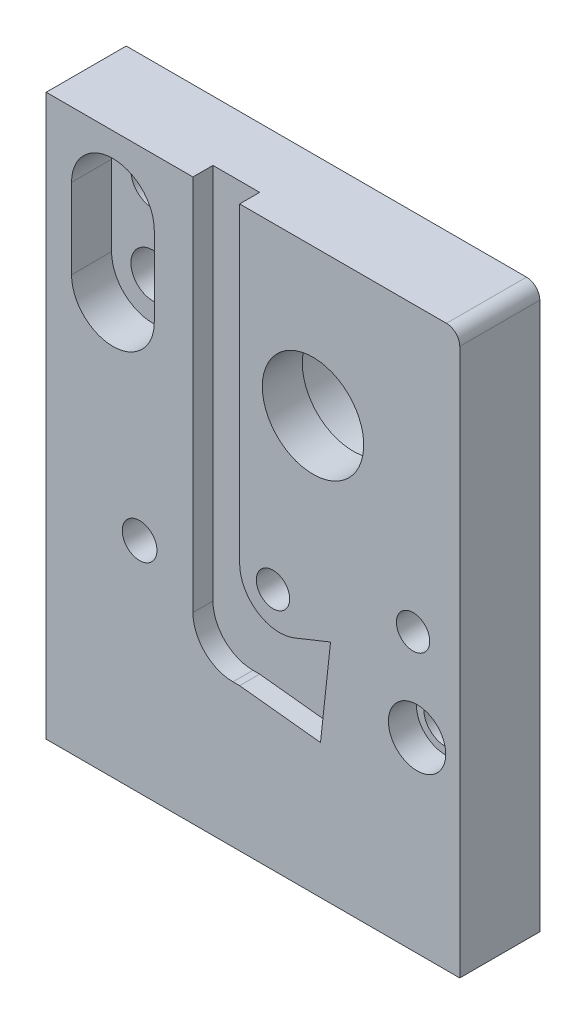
ISO-10303-21;
HEADER;
FILE_DESCRIPTION(('STEP AP214'),'2;1');
FILE_NAME('part.step','',(''),(''),'','','');
FILE_SCHEMA(('AUTOMOTIVE_DESIGN { 1 0 10303 214 1 1 1 1 }'));
ENDSEC;
DATA;
#1=APPLICATION_CONTEXT('core data for automotive mechanical design processes');
#2=APPLICATION_PROTOCOL_DEFINITION('international standard','automotive_design',2000,#1);
#3=PRODUCT_CONTEXT('',#1,'mechanical');
#4=PRODUCT('Part','Part','',(#3));
#5=PRODUCT_RELATED_PRODUCT_CATEGORY('part','',(#4));
#6=PRODUCT_DEFINITION_FORMATION('','',#4);
#7=PRODUCT_DEFINITION_CONTEXT('part definition',#1,'design');
#8=PRODUCT_DEFINITION('design','',#6,#7);
#9=PRODUCT_DEFINITION_SHAPE('','',#8);
#10=(LENGTH_UNIT() NAMED_UNIT(*) SI_UNIT(.MILLI.,.METRE.));
#11=(NAMED_UNIT(*) PLANE_ANGLE_UNIT() SI_UNIT($,.RADIAN.));
#12=(NAMED_UNIT(*) SI_UNIT($,.STERADIAN.) SOLID_ANGLE_UNIT());
#13=UNCERTAINTY_MEASURE_WITH_UNIT(LENGTH_MEASURE(1.E-05),#10,'distance_accuracy_value','');
#14=(GEOMETRIC_REPRESENTATION_CONTEXT(3) GLOBAL_UNCERTAINTY_ASSIGNED_CONTEXT((#13)) GLOBAL_UNIT_ASSIGNED_CONTEXT((#10,
#11,#12)) REPRESENTATION_CONTEXT('',''));
#15=CARTESIAN_POINT('',(0.,0.,0.));
#16=DIRECTION('',(0.,0.,1.));
#17=DIRECTION('',(1.,0.,0.));
#18=AXIS2_PLACEMENT_3D('',#15,#16,#17);
#19=CARTESIAN_POINT('',(20.,31.,6.001));
#20=DIRECTION('',(0.,0.,-1.));
#21=DIRECTION('',(-1.,0.,0.));
#22=AXIS2_PLACEMENT_3D('',#19,#20,#21);
#23=CYLINDRICAL_SURFACE('',#22,3.8);
#24=CARTESIAN_POINT('',(20.,31.,6.));
#25=DIRECTION('',(0.,0.,-1.));
#26=DIRECTION('',(-1.,0.,0.));
#27=AXIS2_PLACEMENT_3D('',#24,#25,#26);
#28=CIRCLE('',#27,3.8);
#29=CARTESIAN_POINT('',(16.2,31.,6.));
#30=VERTEX_POINT('',#29);
#31=EDGE_CURVE('E219',#30,#30,#28,.F.);
#32=CARTESIAN_POINT('',(20.,31.,3.));
#33=DIRECTION('',(0.,0.,-1.));
#34=DIRECTION('',(-1.,0.,0.));
#35=AXIS2_PLACEMENT_3D('',#32,#33,#34);
#36=CIRCLE('',#35,3.8);
#37=CARTESIAN_POINT('',(16.2,31.,3.));
#38=VERTEX_POINT('',#37);
#39=EDGE_CURVE('E210',#38,#38,#36,.T.);
#40=CARTESIAN_POINT('',(16.2,31.,6.));
#41=CARTESIAN_POINT('',(16.2,31.,5.96875));
#42=CARTESIAN_POINT('',(16.2,31.,5.9375));
#43=CARTESIAN_POINT('',(16.2,31.,5.875));
#44=CARTESIAN_POINT('',(16.2,31.,5.84375));
#45=CARTESIAN_POINT('',(16.2,31.,5.78125));
#46=CARTESIAN_POINT('',(16.2,31.,5.75));
#47=CARTESIAN_POINT('',(16.2,31.,5.6875));
#48=CARTESIAN_POINT('',(16.2,31.,5.65625));
#49=CARTESIAN_POINT('',(16.2,31.,5.59375));
#50=CARTESIAN_POINT('',(16.2,31.,5.5625));
#51=CARTESIAN_POINT('',(16.2,31.,5.5));
#52=CARTESIAN_POINT('',(16.2,31.,5.46875));
#53=CARTESIAN_POINT('',(16.2,31.,5.40625));
#54=CARTESIAN_POINT('',(16.2,31.,5.375));
#55=CARTESIAN_POINT('',(16.2,31.,5.3125));
#56=CARTESIAN_POINT('',(16.2,31.,5.28125));
#57=CARTESIAN_POINT('',(16.2,31.,5.21875));
#58=CARTESIAN_POINT('',(16.2,31.,5.1875));
#59=CARTESIAN_POINT('',(16.2,31.,5.125));
#60=CARTESIAN_POINT('',(16.2,31.,5.09375));
#61=CARTESIAN_POINT('',(16.2,31.,5.03125));
#62=CARTESIAN_POINT('',(16.2,31.,5.));
#63=CARTESIAN_POINT('',(16.2,31.,4.9375));
#64=CARTESIAN_POINT('',(16.2,31.,4.90625));
#65=CARTESIAN_POINT('',(16.2,31.,4.84375));
#66=CARTESIAN_POINT('',(16.2,31.,4.8125));
#67=CARTESIAN_POINT('',(16.2,31.,4.75));
#68=CARTESIAN_POINT('',(16.2,31.,4.71875));
#69=CARTESIAN_POINT('',(16.2,31.,4.65625));
#70=CARTESIAN_POINT('',(16.2,31.,4.625));
#71=CARTESIAN_POINT('',(16.2,31.,4.5625));
#72=CARTESIAN_POINT('',(16.2,31.,4.53125));
#73=CARTESIAN_POINT('',(16.2,31.,4.46875));
#74=CARTESIAN_POINT('',(16.2,31.,4.4375));
#75=CARTESIAN_POINT('',(16.2,31.,4.375));
#76=CARTESIAN_POINT('',(16.2,31.,4.34375));
#77=CARTESIAN_POINT('',(16.2,31.,4.28125));
#78=CARTESIAN_POINT('',(16.2,31.,4.25));
#79=CARTESIAN_POINT('',(16.2,31.,4.1875));
#80=CARTESIAN_POINT('',(16.2,31.,4.15625));
#81=CARTESIAN_POINT('',(16.2,31.,4.09375));
#82=CARTESIAN_POINT('',(16.2,31.,4.0625));
#83=CARTESIAN_POINT('',(16.2,31.,4.));
#84=CARTESIAN_POINT('',(16.2,31.,3.96875));
#85=CARTESIAN_POINT('',(16.2,31.,3.90625));
#86=CARTESIAN_POINT('',(16.2,31.,3.875));
#87=CARTESIAN_POINT('',(16.2,31.,3.8125));
#88=CARTESIAN_POINT('',(16.2,31.,3.78125));
#89=CARTESIAN_POINT('',(16.2,31.,3.71875));
#90=CARTESIAN_POINT('',(16.2,31.,3.6875));
#91=CARTESIAN_POINT('',(16.2,31.,3.625));
#92=CARTESIAN_POINT('',(16.2,31.,3.59375));
#93=CARTESIAN_POINT('',(16.2,31.,3.53125));
#94=CARTESIAN_POINT('',(16.2,31.,3.5));
#95=CARTESIAN_POINT('',(16.2,31.,3.4375));
#96=CARTESIAN_POINT('',(16.2,31.,3.40625));
#97=CARTESIAN_POINT('',(16.2,31.,3.34375));
#98=CARTESIAN_POINT('',(16.2,31.,3.3125));
#99=CARTESIAN_POINT('',(16.2,31.,3.25));
#100=CARTESIAN_POINT('',(16.2,31.,3.21875));
#101=CARTESIAN_POINT('',(16.2,31.,3.15625));
#102=CARTESIAN_POINT('',(16.2,31.,3.125));
#103=CARTESIAN_POINT('',(16.2,31.,3.0625));
#104=CARTESIAN_POINT('',(16.2,31.,3.03125));
#105=CARTESIAN_POINT('',(16.2,31.,3.));
#106=B_SPLINE_CURVE_WITH_KNOTS('',3,(#40,#41,#42,#43,#44,#45,#46,#47,#48,#49,#50,#51,#52,#53,
#54,#55,#56,#57,#58,#59,#60,#61,#62,#63,#64,#65,#66,#67,#68,#69,#70,#71,#72,#73,#74,#75,#76,#77,
#78,#79,#80,#81,#82,#83,#84,#85,#86,#87,#88,#89,#90,#91,#92,#93,#94,#95,#96,#97,#98,#99,#100,
#101,#102,#103,#104,#105),.UNSPECIFIED.,.F.,.F.,(4,2,2,2,2,2,2,2,2,2,2,2,2,2,2,2,2,2,2,2,2,2,2,
2,2,2,2,2,2,2,2,2,4),(0.,0.0937500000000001,0.1875,0.28125,0.375,0.46875,0.5625,
0.656250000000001,0.750000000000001,0.843750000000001,0.937500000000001,1.03125,1.125,1.21875,
1.3125,1.40625,1.5,1.59375,1.6875,1.78125,1.875,1.96875,2.0625,2.15625,2.25,2.34375,2.4375,
2.53125,2.625,2.71875,2.8125,2.90625,3.),.UNSPECIFIED.);
#107=EDGE_CURVE('BSEAM35',#30,#38,#106,.T.);
#108=ORIENTED_EDGE('',*,*,#31,.T.);
#109=ORIENTED_EDGE('',*,*,#39,.T.);
#110=ORIENTED_EDGE('',*,*,#107,.T.);
#111=ORIENTED_EDGE('',*,*,#107,.F.);
#112=EDGE_LOOP('',(#108,#110,#109,#111));
#113=FACE_BOUND('',#112,.T.);
#114=ADVANCED_FACE('F35',(#113),#23,.F.);
#115=CARTESIAN_POINT('',(27.8,14.,-0.00100000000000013));
#116=DIRECTION('',(0.,0.,1.));
#117=DIRECTION('',(1.,0.,0.));
#118=AXIS2_PLACEMENT_3D('',#115,#116,#117);
#119=CYLINDRICAL_SURFACE('',#118,1.6);
#120=CARTESIAN_POINT('',(27.8,14.,0.));
#121=DIRECTION('',(0.,0.,-1.));
#122=DIRECTION('',(-1.,0.,0.));
#123=AXIS2_PLACEMENT_3D('',#120,#121,#122);
#124=CIRCLE('',#123,1.6);
#125=CARTESIAN_POINT('',(29.4,14.,0.));
#126=VERTEX_POINT('',#125);
#127=EDGE_CURVE('E231',#126,#126,#124,.F.);
#128=CARTESIAN_POINT('',(27.8,14.,3.9));
#129=DIRECTION('',(0.,0.,1.));
#130=DIRECTION('',(1.,0.,0.));
#131=AXIS2_PLACEMENT_3D('',#128,#129,#130);
#132=CIRCLE('',#131,1.6);
#133=CARTESIAN_POINT('',(29.4,14.,3.9));
#134=VERTEX_POINT('',#133);
#135=EDGE_CURVE('E224',#134,#134,#132,.T.);
#136=CARTESIAN_POINT('',(29.4,14.,0.));
#137=CARTESIAN_POINT('',(29.4,14.,0.040625));
#138=CARTESIAN_POINT('',(29.4,14.,0.08125));
#139=CARTESIAN_POINT('',(29.4,14.,0.1625));
#140=CARTESIAN_POINT('',(29.4,14.,0.203125));
#141=CARTESIAN_POINT('',(29.4,14.,0.284375));
#142=CARTESIAN_POINT('',(29.4,14.,0.325));
#143=CARTESIAN_POINT('',(29.4,14.,0.40625));
#144=CARTESIAN_POINT('',(29.4,14.,0.446875));
#145=CARTESIAN_POINT('',(29.4,14.,0.528125));
#146=CARTESIAN_POINT('',(29.4,14.,0.56875));
#147=CARTESIAN_POINT('',(29.4,14.,0.65));
#148=CARTESIAN_POINT('',(29.4,14.,0.690625));
#149=CARTESIAN_POINT('',(29.4,14.,0.771875));
#150=CARTESIAN_POINT('',(29.4,14.,0.8125));
#151=CARTESIAN_POINT('',(29.4,14.,0.89375));
#152=CARTESIAN_POINT('',(29.4,14.,0.934375));
#153=CARTESIAN_POINT('',(29.4,14.,1.015625));
#154=CARTESIAN_POINT('',(29.4,14.,1.05625));
#155=CARTESIAN_POINT('',(29.4,14.,1.1375));
#156=CARTESIAN_POINT('',(29.4,14.,1.178125));
#157=CARTESIAN_POINT('',(29.4,14.,1.259375));
#158=CARTESIAN_POINT('',(29.4,14.,1.3));
#159=CARTESIAN_POINT('',(29.4,14.,1.38125));
#160=CARTESIAN_POINT('',(29.4,14.,1.421875));
#161=CARTESIAN_POINT('',(29.4,14.,1.503125));
#162=CARTESIAN_POINT('',(29.4,14.,1.54375));
#163=CARTESIAN_POINT('',(29.4,14.,1.625));
#164=CARTESIAN_POINT('',(29.4,14.,1.665625));
#165=CARTESIAN_POINT('',(29.4,14.,1.746875));
#166=CARTESIAN_POINT('',(29.4,14.,1.7875));
#167=CARTESIAN_POINT('',(29.4,14.,1.86875));
#168=CARTESIAN_POINT('',(29.4,14.,1.909375));
#169=CARTESIAN_POINT('',(29.4,14.,1.990625));
#170=CARTESIAN_POINT('',(29.4,14.,2.03125));
#171=CARTESIAN_POINT('',(29.4,14.,2.1125));
#172=CARTESIAN_POINT('',(29.4,14.,2.153125));
#173=CARTESIAN_POINT('',(29.4,14.,2.234375));
#174=CARTESIAN_POINT('',(29.4,14.,2.275));
#175=CARTESIAN_POINT('',(29.4,14.,2.35625));
#176=CARTESIAN_POINT('',(29.4,14.,2.396875));
#177=CARTESIAN_POINT('',(29.4,14.,2.478125));
#178=CARTESIAN_POINT('',(29.4,14.,2.51875));
#179=CARTESIAN_POINT('',(29.4,14.,2.6));
#180=CARTESIAN_POINT('',(29.4,14.,2.640625));
#181=CARTESIAN_POINT('',(29.4,14.,2.721875));
#182=CARTESIAN_POINT('',(29.4,14.,2.7625));
#183=CARTESIAN_POINT('',(29.4,14.,2.84375));
#184=CARTESIAN_POINT('',(29.4,14.,2.884375));
#185=CARTESIAN_POINT('',(29.4,14.,2.965625));
#186=CARTESIAN_POINT('',(29.4,14.,3.00625));
#187=CARTESIAN_POINT('',(29.4,14.,3.0875));
#188=CARTESIAN_POINT('',(29.4,14.,3.128125));
#189=CARTESIAN_POINT('',(29.4,14.,3.209375));
#190=CARTESIAN_POINT('',(29.4,14.,3.25));
#191=CARTESIAN_POINT('',(29.4,14.,3.33125));
#192=CARTESIAN_POINT('',(29.4,14.,3.371875));
#193=CARTESIAN_POINT('',(29.4,14.,3.453125));
#194=CARTESIAN_POINT('',(29.4,14.,3.49375));
#195=CARTESIAN_POINT('',(29.4,14.,3.575));
#196=CARTESIAN_POINT('',(29.4,14.,3.615625));
#197=CARTESIAN_POINT('',(29.4,14.,3.696875));
#198=CARTESIAN_POINT('',(29.4,14.,3.7375));
#199=CARTESIAN_POINT('',(29.4,14.,3.81875));
#200=CARTESIAN_POINT('',(29.4,14.,3.859375));
#201=CARTESIAN_POINT('',(29.4,14.,3.9));
#202=B_SPLINE_CURVE_WITH_KNOTS('',3,(#136,#137,#138,#139,#140,#141,#142,#143,#144,#145,#146,
#147,#148,#149,#150,#151,#152,#153,#154,#155,#156,#157,#158,#159,#160,#161,#162,#163,#164,#165,
#166,#167,#168,#169,#170,#171,#172,#173,#174,#175,#176,#177,#178,#179,#180,#181,#182,#183,#184,
#185,#186,#187,#188,#189,#190,#191,#192,#193,#194,#195,#196,#197,#198,#199,#200,#201),
.UNSPECIFIED.,.F.,.F.,(4,2,2,2,2,2,2,2,2,2,2,2,2,2,2,2,2,2,2,2,2,2,2,2,2,2,2,2,2,2,2,2,4),(0.,
0.121875,0.24375,0.365625,0.4875,0.609375,0.73125,0.853125,0.975,1.096875,1.21875,1.340625,
1.4625,1.584375,1.70625,1.828125,1.95,2.071875,2.19375,2.315625,2.4375,2.559375,2.68125,
2.803125,2.925,3.046875,3.16875,3.290625,3.4125,3.534375,3.65625,3.778125,3.9),.UNSPECIFIED.);
#203=EDGE_CURVE('BSEAM422',#126,#134,#202,.T.);
#204=ORIENTED_EDGE('',*,*,#127,.F.);
#205=ORIENTED_EDGE('',*,*,#135,.T.);
#206=ORIENTED_EDGE('',*,*,#203,.T.);
#207=ORIENTED_EDGE('',*,*,#203,.F.);
#208=EDGE_LOOP('',(#204,#206,#205,#207));
#209=FACE_BOUND('',#208,.T.);
#210=ADVANCED_FACE('F422',(#209),#119,.F.);
#211=CARTESIAN_POINT('',(5.,31.1,-0.00100000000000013));
#212=DIRECTION('',(0.,0.,1.));
#213=DIRECTION('',(1.,0.,0.));
#214=AXIS2_PLACEMENT_3D('',#211,#212,#213);
#215=CYLINDRICAL_SURFACE('',#214,1.65);
#216=CARTESIAN_POINT('',(5.,31.1,0.));
#217=DIRECTION('',(0.,0.,-1.));
#218=DIRECTION('',(-1.,0.,0.));
#219=AXIS2_PLACEMENT_3D('',#216,#217,#218);
#220=CIRCLE('',#219,1.65);
#221=CARTESIAN_POINT('',(6.65,31.1,0.));
#222=VERTEX_POINT('',#221);
#223=EDGE_CURVE('E268',#222,#222,#220,.F.);
#224=CARTESIAN_POINT('',(5.,31.1,3.));
#225=DIRECTION('',(0.,0.,1.));
#226=DIRECTION('',(1.,0.,0.));
#227=AXIS2_PLACEMENT_3D('',#224,#225,#226);
#228=CIRCLE('',#227,1.65);
#229=CARTESIAN_POINT('',(6.65,31.1,3.));
#230=VERTEX_POINT('',#229);
#231=EDGE_CURVE('E239',#230,#230,#228,.T.);
#232=CARTESIAN_POINT('',(6.65,31.1,0.));
#233=CARTESIAN_POINT('',(6.65,31.1,0.03125));
#234=CARTESIAN_POINT('',(6.65,31.1,0.0625));
#235=CARTESIAN_POINT('',(6.65,31.1,0.125));
#236=CARTESIAN_POINT('',(6.65,31.1,0.15625));
#237=CARTESIAN_POINT('',(6.65,31.1,0.21875));
#238=CARTESIAN_POINT('',(6.65,31.1,0.25));
#239=CARTESIAN_POINT('',(6.65,31.1,0.3125));
#240=CARTESIAN_POINT('',(6.65,31.1,0.34375));
#241=CARTESIAN_POINT('',(6.65,31.1,0.40625));
#242=CARTESIAN_POINT('',(6.65,31.1,0.4375));
#243=CARTESIAN_POINT('',(6.65,31.1,0.5));
#244=CARTESIAN_POINT('',(6.65,31.1,0.53125));
#245=CARTESIAN_POINT('',(6.65,31.1,0.59375));
#246=CARTESIAN_POINT('',(6.65,31.1,0.625));
#247=CARTESIAN_POINT('',(6.65,31.1,0.6875));
#248=CARTESIAN_POINT('',(6.65,31.1,0.71875));
#249=CARTESIAN_POINT('',(6.65,31.1,0.78125));
#250=CARTESIAN_POINT('',(6.65,31.1,0.8125));
#251=CARTESIAN_POINT('',(6.65,31.1,0.875));
#252=CARTESIAN_POINT('',(6.65,31.1,0.90625));
#253=CARTESIAN_POINT('',(6.65,31.1,0.96875));
#254=CARTESIAN_POINT('',(6.65,31.1,1.));
#255=CARTESIAN_POINT('',(6.65,31.1,1.0625));
#256=CARTESIAN_POINT('',(6.65,31.1,1.09375));
#257=CARTESIAN_POINT('',(6.65,31.1,1.15625));
#258=CARTESIAN_POINT('',(6.65,31.1,1.1875));
#259=CARTESIAN_POINT('',(6.65,31.1,1.25));
#260=CARTESIAN_POINT('',(6.65,31.1,1.28125));
#261=CARTESIAN_POINT('',(6.65,31.1,1.34375));
#262=CARTESIAN_POINT('',(6.65,31.1,1.375));
#263=CARTESIAN_POINT('',(6.65,31.1,1.4375));
#264=CARTESIAN_POINT('',(6.65,31.1,1.46875));
#265=CARTESIAN_POINT('',(6.65,31.1,1.53125));
#266=CARTESIAN_POINT('',(6.65,31.1,1.5625));
#267=CARTESIAN_POINT('',(6.65,31.1,1.625));
#268=CARTESIAN_POINT('',(6.65,31.1,1.65625));
#269=CARTESIAN_POINT('',(6.65,31.1,1.71875));
#270=CARTESIAN_POINT('',(6.65,31.1,1.75));
#271=CARTESIAN_POINT('',(6.65,31.1,1.8125));
#272=CARTESIAN_POINT('',(6.65,31.1,1.84375));
#273=CARTESIAN_POINT('',(6.65,31.1,1.90625));
#274=CARTESIAN_POINT('',(6.65,31.1,1.9375));
#275=CARTESIAN_POINT('',(6.65,31.1,2.));
#276=CARTESIAN_POINT('',(6.65,31.1,2.03125));
#277=CARTESIAN_POINT('',(6.65,31.1,2.09375));
#278=CARTESIAN_POINT('',(6.65,31.1,2.125));
#279=CARTESIAN_POINT('',(6.65,31.1,2.1875));
#280=CARTESIAN_POINT('',(6.65,31.1,2.21875));
#281=CARTESIAN_POINT('',(6.65,31.1,2.28125));
#282=CARTESIAN_POINT('',(6.65,31.1,2.3125));
#283=CARTESIAN_POINT('',(6.65,31.1,2.375));
#284=CARTESIAN_POINT('',(6.65,31.1,2.40625));
#285=CARTESIAN_POINT('',(6.65,31.1,2.46875));
#286=CARTESIAN_POINT('',(6.65,31.1,2.5));
#287=CARTESIAN_POINT('',(6.65,31.1,2.5625));
#288=CARTESIAN_POINT('',(6.65,31.1,2.59375));
#289=CARTESIAN_POINT('',(6.65,31.1,2.65625));
#290=CARTESIAN_POINT('',(6.65,31.1,2.6875));
#291=CARTESIAN_POINT('',(6.65,31.1,2.75));
#292=CARTESIAN_POINT('',(6.65,31.1,2.78125));
#293=CARTESIAN_POINT('',(6.65,31.1,2.84375));
#294=CARTESIAN_POINT('',(6.65,31.1,2.875));
#295=CARTESIAN_POINT('',(6.65,31.1,2.9375));
#296=CARTESIAN_POINT('',(6.65,31.1,2.96875));
#297=CARTESIAN_POINT('',(6.65,31.1,3.));
#298=B_SPLINE_CURVE_WITH_KNOTS('',3,(#232,#233,#234,#235,#236,#237,#238,#239,#240,#241,#242,
#243,#244,#245,#246,#247,#248,#249,#250,#251,#252,#253,#254,#255,#256,#257,#258,#259,#260,#261,
#262,#263,#264,#265,#266,#267,#268,#269,#270,#271,#272,#273,#274,#275,#276,#277,#278,#279,#280,
#281,#282,#283,#284,#285,#286,#287,#288,#289,#290,#291,#292,#293,#294,#295,#296,#297),
.UNSPECIFIED.,.F.,.F.,(4,2,2,2,2,2,2,2,2,2,2,2,2,2,2,2,2,2,2,2,2,2,2,2,2,2,2,2,2,2,2,2,4),(0.,
0.09375,0.1875,0.28125,0.375,0.46875,0.5625,0.65625,0.75,0.84375,0.9375,1.03125,1.125,1.21875,
1.3125,1.40625,1.5,1.59375,1.6875,1.78125,1.875,1.96875,2.0625,2.15625,2.25,2.34375,2.4375,
2.53125,2.625,2.71875,2.8125,2.90625,3.),.UNSPECIFIED.);
#299=EDGE_CURVE('BSEAM429',#222,#230,#298,.T.);
#300=ORIENTED_EDGE('',*,*,#223,.F.);
#301=ORIENTED_EDGE('',*,*,#231,.T.);
#302=ORIENTED_EDGE('',*,*,#299,.T.);
#303=ORIENTED_EDGE('',*,*,#299,.F.);
#304=EDGE_LOOP('',(#300,#302,#301,#303));
#305=FACE_BOUND('',#304,.T.);
#306=ADVANCED_FACE('F429',(#305),#215,.F.);
#307=CARTESIAN_POINT('',(5.,37.1,-0.00100000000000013));
#308=DIRECTION('',(0.,0.,1.));
#309=DIRECTION('',(1.,0.,0.));
#310=AXIS2_PLACEMENT_3D('',#307,#308,#309);
#311=CYLINDRICAL_SURFACE('',#310,1.65);
#312=CARTESIAN_POINT('',(5.,37.1,0.));
#313=DIRECTION('',(0.,0.,-1.));
#314=DIRECTION('',(-1.,0.,0.));
#315=AXIS2_PLACEMENT_3D('',#312,#313,#314);
#316=CIRCLE('',#315,1.65);
#317=CARTESIAN_POINT('',(6.65,37.1,0.));
#318=VERTEX_POINT('',#317);
#319=EDGE_CURVE('E275',#318,#318,#316,.F.);
#320=CARTESIAN_POINT('',(5.,37.1,3.));
#321=DIRECTION('',(0.,0.,1.));
#322=DIRECTION('',(1.,0.,0.));
#323=AXIS2_PLACEMENT_3D('',#320,#321,#322);
#324=CIRCLE('',#323,1.65);
#325=CARTESIAN_POINT('',(6.65,37.1,3.));
#326=VERTEX_POINT('',#325);
#327=EDGE_CURVE('E236',#326,#326,#324,.T.);
#328=CARTESIAN_POINT('',(6.65,37.1,0.));
#329=CARTESIAN_POINT('',(6.65,37.1,0.03125));
#330=CARTESIAN_POINT('',(6.65,37.1,0.0625));
#331=CARTESIAN_POINT('',(6.65,37.1,0.125));
#332=CARTESIAN_POINT('',(6.65,37.1,0.15625));
#333=CARTESIAN_POINT('',(6.65,37.1,0.21875));
#334=CARTESIAN_POINT('',(6.65,37.1,0.25));
#335=CARTESIAN_POINT('',(6.65,37.1,0.3125));
#336=CARTESIAN_POINT('',(6.65,37.1,0.34375));
#337=CARTESIAN_POINT('',(6.65,37.1,0.40625));
#338=CARTESIAN_POINT('',(6.65,37.1,0.4375));
#339=CARTESIAN_POINT('',(6.65,37.1,0.5));
#340=CARTESIAN_POINT('',(6.65,37.1,0.53125));
#341=CARTESIAN_POINT('',(6.65,37.1,0.59375));
#342=CARTESIAN_POINT('',(6.65,37.1,0.625));
#343=CARTESIAN_POINT('',(6.65,37.1,0.6875));
#344=CARTESIAN_POINT('',(6.65,37.1,0.71875));
#345=CARTESIAN_POINT('',(6.65,37.1,0.78125));
#346=CARTESIAN_POINT('',(6.65,37.1,0.8125));
#347=CARTESIAN_POINT('',(6.65,37.1,0.875));
#348=CARTESIAN_POINT('',(6.65,37.1,0.90625));
#349=CARTESIAN_POINT('',(6.65,37.1,0.96875));
#350=CARTESIAN_POINT('',(6.65,37.1,1.));
#351=CARTESIAN_POINT('',(6.65,37.1,1.0625));
#352=CARTESIAN_POINT('',(6.65,37.1,1.09375));
#353=CARTESIAN_POINT('',(6.65,37.1,1.15625));
#354=CARTESIAN_POINT('',(6.65,37.1,1.1875));
#355=CARTESIAN_POINT('',(6.65,37.1,1.25));
#356=CARTESIAN_POINT('',(6.65,37.1,1.28125));
#357=CARTESIAN_POINT('',(6.65,37.1,1.34375));
#358=CARTESIAN_POINT('',(6.65,37.1,1.375));
#359=CARTESIAN_POINT('',(6.65,37.1,1.4375));
#360=CARTESIAN_POINT('',(6.65,37.1,1.46875));
#361=CARTESIAN_POINT('',(6.65,37.1,1.53125));
#362=CARTESIAN_POINT('',(6.65,37.1,1.5625));
#363=CARTESIAN_POINT('',(6.65,37.1,1.625));
#364=CARTESIAN_POINT('',(6.65,37.1,1.65625));
#365=CARTESIAN_POINT('',(6.65,37.1,1.71875));
#366=CARTESIAN_POINT('',(6.65,37.1,1.75));
#367=CARTESIAN_POINT('',(6.65,37.1,1.8125));
#368=CARTESIAN_POINT('',(6.65,37.1,1.84375));
#369=CARTESIAN_POINT('',(6.65,37.1,1.90625));
#370=CARTESIAN_POINT('',(6.65,37.1,1.9375));
#371=CARTESIAN_POINT('',(6.65,37.1,2.));
#372=CARTESIAN_POINT('',(6.65,37.1,2.03125));
#373=CARTESIAN_POINT('',(6.65,37.1,2.09375));
#374=CARTESIAN_POINT('',(6.65,37.1,2.125));
#375=CARTESIAN_POINT('',(6.65,37.1,2.1875));
#376=CARTESIAN_POINT('',(6.65,37.1,2.21875));
#377=CARTESIAN_POINT('',(6.65,37.1,2.28125));
#378=CARTESIAN_POINT('',(6.65,37.1,2.3125));
#379=CARTESIAN_POINT('',(6.65,37.1,2.375));
#380=CARTESIAN_POINT('',(6.65,37.1,2.40625));
#381=CARTESIAN_POINT('',(6.65,37.1,2.46875));
#382=CARTESIAN_POINT('',(6.65,37.1,2.5));
#383=CARTESIAN_POINT('',(6.65,37.1,2.5625));
#384=CARTESIAN_POINT('',(6.65,37.1,2.59375));
#385=CARTESIAN_POINT('',(6.65,37.1,2.65625));
#386=CARTESIAN_POINT('',(6.65,37.1,2.6875));
#387=CARTESIAN_POINT('',(6.65,37.1,2.75));
#388=CARTESIAN_POINT('',(6.65,37.1,2.78125));
#389=CARTESIAN_POINT('',(6.65,37.1,2.84375));
#390=CARTESIAN_POINT('',(6.65,37.1,2.875));
#391=CARTESIAN_POINT('',(6.65,37.1,2.9375));
#392=CARTESIAN_POINT('',(6.65,37.1,2.96875));
#393=CARTESIAN_POINT('',(6.65,37.1,3.));
#394=B_SPLINE_CURVE_WITH_KNOTS('',3,(#328,#329,#330,#331,#332,#333,#334,#335,#336,#337,#338,
#339,#340,#341,#342,#343,#344,#345,#346,#347,#348,#349,#350,#351,#352,#353,#354,#355,#356,#357,
#358,#359,#360,#361,#362,#363,#364,#365,#366,#367,#368,#369,#370,#371,#372,#373,#374,#375,#376,
#377,#378,#379,#380,#381,#382,#383,#384,#385,#386,#387,#388,#389,#390,#391,#392,#393),
.UNSPECIFIED.,.F.,.F.,(4,2,2,2,2,2,2,2,2,2,2,2,2,2,2,2,2,2,2,2,2,2,2,2,2,2,2,2,2,2,2,2,4),(0.,
0.09375,0.1875,0.28125,0.375,0.46875,0.5625,0.65625,0.75,0.84375,0.9375,1.03125,1.125,1.21875,
1.3125,1.40625,1.5,1.59375,1.6875,1.78125,1.875,1.96875,2.0625,2.15625,2.25,2.34375,2.4375,
2.53125,2.625,2.71875,2.8125,2.90625,3.),.UNSPECIFIED.);
#395=EDGE_CURVE('BSEAM466',#318,#326,#394,.T.);
#396=ORIENTED_EDGE('',*,*,#319,.F.);
#397=ORIENTED_EDGE('',*,*,#327,.T.);
#398=ORIENTED_EDGE('',*,*,#395,.T.);
#399=ORIENTED_EDGE('',*,*,#395,.F.);
#400=EDGE_LOOP('',(#396,#398,#397,#399));
#401=FACE_BOUND('',#400,.T.);
#402=ADVANCED_FACE('F466',(#401),#311,.F.);
#403=CARTESIAN_POINT('',(0.,0.,6.));
#404=DIRECTION('',(1.,0.,0.));
#405=DIRECTION('',(0.,0.,-1.));
#406=AXIS2_PLACEMENT_3D('',#403,#404,#405);
#407=PLANE('',#406);
#408=DIRECTION('',(0.,-1.,0.));
#409=VECTOR('',#408,1.);
#410=CARTESIAN_POINT('',(0.,0.,0.));
#411=LINE('',#410,#409);
#412=CARTESIAN_POINT('',(0.,42.,0.));
#413=VERTEX_POINT('',#412);
#414=CARTESIAN_POINT('',(0.,0.,0.));
#415=VERTEX_POINT('',#414);
#416=EDGE_CURVE('E284',#413,#415,#411,.T.);
#417=ORIENTED_EDGE('',*,*,#416,.T.);
#418=DIRECTION('',(0.,0.,-1.));
#419=VECTOR('',#418,1.);
#420=CARTESIAN_POINT('',(0.,0.,6.));
#421=LINE('',#420,#419);
#422=CARTESIAN_POINT('',(0.,0.,6.));
#423=VERTEX_POINT('',#422);
#424=EDGE_CURVE('E319',#423,#415,#421,.T.);
#425=ORIENTED_EDGE('',*,*,#424,.F.);
#426=DIRECTION('',(0.,-1.,0.));
#427=VECTOR('',#426,1.);
#428=CARTESIAN_POINT('',(0.,0.,6.));
#429=LINE('',#428,#427);
#430=CARTESIAN_POINT('',(0.,42.,6.));
#431=VERTEX_POINT('',#430);
#432=EDGE_CURVE('E293',#431,#423,#429,.T.);
#433=ORIENTED_EDGE('',*,*,#432,.F.);
#434=DIRECTION('',(0.,0.,-1.));
#435=VECTOR('',#434,1.);
#436=CARTESIAN_POINT('',(0.,42.,6.));
#437=LINE('',#436,#435);
#438=EDGE_CURVE('E305',#431,#413,#437,.T.);
#439=ORIENTED_EDGE('',*,*,#438,.T.);
#440=EDGE_LOOP('',(#417,#425,#433,#439));
#441=FACE_BOUND('',#440,.T.);
#442=ADVANCED_FACE('F403',(#441),#407,.F.);
#443=CARTESIAN_POINT('',(0.,0.,6.));
#444=DIRECTION('',(0.,1.,0.));
#445=DIRECTION('',(0.,0.,1.));
#446=AXIS2_PLACEMENT_3D('',#443,#444,#445);
#447=PLANE('',#446);
#448=CARTESIAN_POINT('',(9.,0.,3.));
#449=DIRECTION('',(0.,-1.,0.));
#450=DIRECTION('',(0.,0.,-1.));
#451=AXIS2_PLACEMENT_3D('',#448,#449,#450);
#452=CIRCLE('',#451,1.3);
#453=CARTESIAN_POINT('',(9.,0.,1.7));
#454=VERTEX_POINT('',#453);
#455=EDGE_CURVE('E285',#454,#454,#452,.T.);
#456=ORIENTED_EDGE('',*,*,#455,.F.);
#457=EDGE_LOOP('',(#456));
#458=FACE_BOUND('',#457,.T.);
#459=CARTESIAN_POINT('',(17.6,0.,3.));
#460=DIRECTION('',(0.,-1.,0.));
#461=DIRECTION('',(0.,0.,-1.));
#462=AXIS2_PLACEMENT_3D('',#459,#460,#461);
#463=CIRCLE('',#462,1.29999999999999);
#464=CARTESIAN_POINT('',(17.6,0.,1.70000000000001));
#465=VERTEX_POINT('',#464);
#466=EDGE_CURVE('E278',#465,#465,#463,.T.);
#467=ORIENTED_EDGE('',*,*,#466,.F.);
#468=EDGE_LOOP('',(#467));
#469=FACE_BOUND('',#468,.T.);
#470=DIRECTION('',(1.,0.,0.));
#471=VECTOR('',#470,1.);
#472=CARTESIAN_POINT('',(0.,0.,0.));
#473=LINE('',#472,#471);
#474=CARTESIAN_POINT('',(31.,0.,0.));
#475=VERTEX_POINT('',#474);
#476=EDGE_CURVE('E308',#415,#475,#473,.T.);
#477=ORIENTED_EDGE('',*,*,#476,.T.);
#478=DIRECTION('',(0.,0.,-1.));
#479=VECTOR('',#478,1.);
#480=CARTESIAN_POINT('',(31.,0.,6.));
#481=LINE('',#480,#479);
#482=CARTESIAN_POINT('',(31.,0.,6.));
#483=VERTEX_POINT('',#482);
#484=EDGE_CURVE('E316',#483,#475,#481,.T.);
#485=ORIENTED_EDGE('',*,*,#484,.F.);
#486=DIRECTION('',(1.,0.,0.));
#487=VECTOR('',#486,1.);
#488=CARTESIAN_POINT('',(0.,0.,6.));
#489=LINE('',#488,#487);
#490=EDGE_CURVE('E296',#423,#483,#489,.T.);
#491=ORIENTED_EDGE('',*,*,#490,.F.);
#492=ORIENTED_EDGE('',*,*,#424,.T.);
#493=EDGE_LOOP('',(#477,#485,#491,#492));
#494=FACE_BOUND('',#493,.T.);
#495=ADVANCED_FACE('F407',(#458,#469,#494),#447,.F.);
#496=CARTESIAN_POINT('',(31.,0.,6.));
#497=DIRECTION('',(-1.,0.,0.));
#498=DIRECTION('',(0.,0.,1.));
#499=AXIS2_PLACEMENT_3D('',#496,#497,#498);
#500=PLANE('',#499);
#501=DIRECTION('',(0.,1.,0.));
#502=VECTOR('',#501,1.);
#503=CARTESIAN_POINT('',(31.,0.,0.));
#504=LINE('',#503,#502);
#505=CARTESIAN_POINT('',(31.,41.,0.));
#506=VERTEX_POINT('',#505);
#507=EDGE_CURVE('E310',#475,#506,#504,.T.);
#508=ORIENTED_EDGE('',*,*,#507,.T.);
#509=DIRECTION('',(0.,0.,-1.));
#510=VECTOR('',#509,1.);
#511=CARTESIAN_POINT('',(31.,41.,6.));
#512=LINE('',#511,#510);
#513=CARTESIAN_POINT('',(31.,41.,6.));
#514=VERTEX_POINT('',#513);
#515=EDGE_CURVE('E327',#506,#514,#512,.F.);
#516=ORIENTED_EDGE('',*,*,#515,.T.);
#517=DIRECTION('',(0.,1.,0.));
#518=VECTOR('',#517,1.);
#519=CARTESIAN_POINT('',(31.,0.,6.));
#520=LINE('',#519,#518);
#521=EDGE_CURVE('E299',#483,#514,#520,.T.);
#522=ORIENTED_EDGE('',*,*,#521,.F.);
#523=ORIENTED_EDGE('',*,*,#484,.T.);
#524=EDGE_LOOP('',(#508,#516,#522,#523));
#525=FACE_BOUND('',#524,.T.);
#526=ADVANCED_FACE('F409',(#525),#500,.F.);
#527=CARTESIAN_POINT('',(0.,42.,6.));
#528=DIRECTION('',(0.,-1.,0.));
#529=DIRECTION('',(0.,0.,-1.));
#530=AXIS2_PLACEMENT_3D('',#527,#528,#529);
#531=PLANE('',#530);
#532=DIRECTION('',(-1.,0.,0.));
#533=VECTOR('',#532,1.);
#534=CARTESIAN_POINT('',(11.,42.,4.5));
#535=LINE('',#534,#533);
#536=CARTESIAN_POINT('',(14.5,42.,4.5));
#537=VERTEX_POINT('',#536);
#538=CARTESIAN_POINT('',(11.,42.,4.5));
#539=VERTEX_POINT('',#538);
#540=EDGE_CURVE('E171',#537,#539,#535,.T.);
#541=ORIENTED_EDGE('',*,*,#540,.F.);
#542=DIRECTION('',(0.,0.,1.));
#543=VECTOR('',#542,1.);
#544=CARTESIAN_POINT('',(14.5,42.,4.5));
#545=LINE('',#544,#543);
#546=CARTESIAN_POINT('',(14.5,42.,6.));
#547=VERTEX_POINT('',#546);
#548=EDGE_CURVE('E206',#537,#547,#545,.T.);
#549=ORIENTED_EDGE('',*,*,#548,.T.);
#550=DIRECTION('',(-1.,0.,0.));
#551=VECTOR('',#550,1.);
#552=CARTESIAN_POINT('',(0.,42.,6.));
#553=LINE('',#552,#551);
#554=CARTESIAN_POINT('',(30.,42.,6.));
#555=VERTEX_POINT('',#554);
#556=EDGE_CURVE('E302',#555,#547,#553,.T.);
#557=ORIENTED_EDGE('',*,*,#556,.F.);
#558=DIRECTION('',(0.,0.,-1.));
#559=VECTOR('',#558,1.);
#560=CARTESIAN_POINT('',(30.,42.,6.));
#561=LINE('',#560,#559);
#562=CARTESIAN_POINT('',(30.,42.,0.));
#563=VERTEX_POINT('',#562);
#564=EDGE_CURVE('E322',#555,#563,#561,.T.);
#565=ORIENTED_EDGE('',*,*,#564,.T.);
#566=DIRECTION('',(-1.,0.,0.));
#567=VECTOR('',#566,1.);
#568=CARTESIAN_POINT('',(0.,42.,0.));
#569=LINE('',#568,#567);
#570=EDGE_CURVE('E297',#563,#413,#569,.T.);
#571=ORIENTED_EDGE('',*,*,#570,.T.);
#572=ORIENTED_EDGE('',*,*,#438,.F.);
#573=CARTESIAN_POINT('',(11.,42.,6.));
#574=VERTEX_POINT('',#573);
#575=EDGE_CURVE('E185',#574,#431,#553,.T.);
#576=ORIENTED_EDGE('',*,*,#575,.F.);
#577=DIRECTION('',(0.,0.,1.));
#578=VECTOR('',#577,1.);
#579=CARTESIAN_POINT('',(11.,42.,4.5));
#580=LINE('',#579,#578);
#581=EDGE_CURVE('E165',#539,#574,#580,.T.);
#582=ORIENTED_EDGE('',*,*,#581,.F.);
#583=EDGE_LOOP('',(#541,#549,#557,#565,#571,#572,#576,#582));
#584=FACE_BOUND('',#583,.T.);
#585=ADVANCED_FACE('F183',(#584),#531,.F.);
#586=CARTESIAN_POINT('',(0.,0.,6.));
#587=DIRECTION('',(0.,0.,-1.));
#588=DIRECTION('',(-1.,0.,0.));
#589=AXIS2_PLACEMENT_3D('',#586,#587,#588);
#590=PLANE('',#589);
#591=CARTESIAN_POINT('',(17.,18.2264803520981,6.));
#592=DIRECTION('',(0.,0.,1.));
#593=DIRECTION('',(1.,0.,0.));
#594=AXIS2_PLACEMENT_3D('',#591,#592,#593);
#595=CIRCLE('',#594,1.25);
#596=CARTESIAN_POINT('',(18.25,18.2264803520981,6.));
#597=VERTEX_POINT('',#596);
#598=EDGE_CURVE('E193',#597,#597,#595,.T.);
#599=ORIENTED_EDGE('',*,*,#598,.F.);
#600=EDGE_LOOP('',(#599));
#601=FACE_BOUND('',#600,.T.);
#602=CARTESIAN_POINT('',(27.5,20.7264803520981,6.));
#603=DIRECTION('',(0.,0.,1.));
#604=DIRECTION('',(1.,0.,0.));
#605=AXIS2_PLACEMENT_3D('',#602,#603,#604);
#606=CIRCLE('',#605,1.25);
#607=CARTESIAN_POINT('',(28.75,20.7264803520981,6.));
#608=VERTEX_POINT('',#607);
#609=EDGE_CURVE('E200',#608,#608,#606,.T.);
#610=ORIENTED_EDGE('',*,*,#609,.F.);
#611=EDGE_LOOP('',(#610));
#612=FACE_BOUND('',#611,.T.);
#613=CARTESIAN_POINT('',(7.00000000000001,16.4,6.));
#614=DIRECTION('',(0.,0.,1.));
#615=DIRECTION('',(1.,0.,0.));
#616=AXIS2_PLACEMENT_3D('',#613,#614,#615);
#617=CIRCLE('',#616,1.3);
#618=CARTESIAN_POINT('',(8.30000000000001,16.4,6.));
#619=VERTEX_POINT('',#618);
#620=EDGE_CURVE('E207',#619,#619,#617,.T.);
#621=ORIENTED_EDGE('',*,*,#620,.F.);
#622=EDGE_LOOP('',(#621));
#623=FACE_BOUND('',#622,.T.);
#624=ORIENTED_EDGE('',*,*,#31,.F.);
#625=EDGE_LOOP('',(#624));
#626=FACE_BOUND('',#625,.T.);
#627=CARTESIAN_POINT('',(27.8,14.,6.));
#628=DIRECTION('',(0.,0.,1.));
#629=DIRECTION('',(1.,0.,0.));
#630=AXIS2_PLACEMENT_3D('',#627,#628,#629);
#631=CIRCLE('',#630,2.15);
#632=CARTESIAN_POINT('',(29.95,14.,6.));
#633=VERTEX_POINT('',#632);
#634=EDGE_CURVE('E227',#633,#633,#631,.T.);
#635=ORIENTED_EDGE('',*,*,#634,.F.);
#636=EDGE_LOOP('',(#635));
#637=FACE_BOUND('',#636,.T.);
#638=DIRECTION('',(0.,1.,0.));
#639=VECTOR('',#638,1.);
#640=CARTESIAN_POINT('',(8.1,31.1,6.));
#641=LINE('',#640,#639);
#642=CARTESIAN_POINT('',(8.1,31.1,6.));
#643=VERTEX_POINT('',#642);
#644=CARTESIAN_POINT('',(8.1,37.1,6.));
#645=VERTEX_POINT('',#644);
#646=EDGE_CURVE('E258',#643,#645,#641,.T.);
#647=ORIENTED_EDGE('',*,*,#646,.F.);
#648=CARTESIAN_POINT('',(5.,31.1,6.));
#649=DIRECTION('',(0.,0.,1.));
#650=DIRECTION('',(1.,0.,0.));
#651=AXIS2_PLACEMENT_3D('',#648,#649,#650);
#652=CIRCLE('',#651,3.1);
#653=CARTESIAN_POINT('',(1.9,31.1,6.));
#654=VERTEX_POINT('',#653);
#655=EDGE_CURVE('E242',#654,#643,#652,.T.);
#656=ORIENTED_EDGE('',*,*,#655,.F.);
#657=DIRECTION('',(0.,-1.,0.));
#658=VECTOR('',#657,1.);
#659=CARTESIAN_POINT('',(1.9,31.1,6.));
#660=LINE('',#659,#658);
#661=CARTESIAN_POINT('',(1.9,37.1,6.));
#662=VERTEX_POINT('',#661);
#663=EDGE_CURVE('E247',#662,#654,#660,.T.);
#664=ORIENTED_EDGE('',*,*,#663,.F.);
#665=CARTESIAN_POINT('',(5.,37.1,6.));
#666=DIRECTION('',(0.,0.,1.));
#667=DIRECTION('',(1.,0.,0.));
#668=AXIS2_PLACEMENT_3D('',#665,#666,#667);
#669=CIRCLE('',#668,3.1);
#670=EDGE_CURVE('E261',#645,#662,#669,.T.);
#671=ORIENTED_EDGE('',*,*,#670,.F.);
#672=EDGE_LOOP('',(#647,#656,#664,#671));
#673=FACE_BOUND('',#672,.T.);
#674=DIRECTION('',(-0.927818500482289,-0.373031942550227,0.));
#675=VECTOR('',#674,1.);
#676=CARTESIAN_POINT('',(19.7360716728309,16.3316571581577,6.));
#677=LINE('',#676,#675);
#678=CARTESIAN_POINT('',(21.3140840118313,16.9661012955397,6.));
#679=VERTEX_POINT('',#678);
#680=CARTESIAN_POINT('',(18.6190958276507,15.8825739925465,6.));
#681=VERTEX_POINT('',#680);
#682=EDGE_CURVE('E339',#679,#681,#677,.T.);
#683=ORIENTED_EDGE('',*,*,#682,.F.);
#684=DIRECTION('',(-0.108325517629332,-0.994115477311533,0.));
#685=VECTOR('',#684,1.);
#686=CARTESIAN_POINT('',(19.236928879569,-2.09618532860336,6.));
#687=LINE('',#686,#685);
#688=CARTESIAN_POINT('',(20.5621919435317,10.0659030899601,6.));
#689=VERTEX_POINT('',#688);
#690=EDGE_CURVE('E331',#679,#689,#687,.T.);
#691=ORIENTED_EDGE('',*,*,#690,.T.);
#692=DIRECTION('',(0.994115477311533,-0.108325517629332,0.));
#693=VECTOR('',#692,1.);
#694=CARTESIAN_POINT('',(16.8326026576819,10.4723042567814,6.));
#695=LINE('',#694,#693);
#696=CARTESIAN_POINT('',(14.5,10.7264803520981,6.));
#697=VERTEX_POINT('',#696);
#698=EDGE_CURVE('E348',#697,#689,#695,.T.);
#699=ORIENTED_EDGE('',*,*,#698,.F.);
#700=DIRECTION('',(1.,0.,0.));
#701=VECTOR('',#700,1.);
#702=CARTESIAN_POINT('',(14.,10.7264803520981,6.));
#703=LINE('',#702,#701);
#704=CARTESIAN_POINT('',(14.,10.7264803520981,6.));
#705=VERTEX_POINT('',#704);
#706=EDGE_CURVE('E354',#705,#697,#703,.T.);
#707=ORIENTED_EDGE('',*,*,#706,.F.);
#708=CARTESIAN_POINT('',(14.,13.7264803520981,6.));
#709=DIRECTION('',(0.,0.,1.));
#710=DIRECTION('',(1.,0.,0.));
#711=AXIS2_PLACEMENT_3D('',#708,#709,#710);
#712=CIRCLE('',#711,3.);
#713=CARTESIAN_POINT('',(11.,13.7264803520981,6.));
#714=VERTEX_POINT('',#713);
#715=EDGE_CURVE('E373',#714,#705,#712,.T.);
#716=ORIENTED_EDGE('',*,*,#715,.F.);
#717=DIRECTION('',(0.,-1.,0.));
#718=VECTOR('',#717,1.);
#719=CARTESIAN_POINT('',(11.,38.2264803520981,6.));
#720=LINE('',#719,#718);
#721=EDGE_CURVE('E375',#574,#714,#720,.T.);
#722=ORIENTED_EDGE('',*,*,#721,.F.);
#723=ORIENTED_EDGE('',*,*,#575,.T.);
#724=ORIENTED_EDGE('',*,*,#432,.T.);
#725=ORIENTED_EDGE('',*,*,#490,.T.);
#726=ORIENTED_EDGE('',*,*,#521,.T.);
#727=CARTESIAN_POINT('',(30.,41.,6.));
#728=DIRECTION('',(0.,0.,-1.));
#729=DIRECTION('',(-1.,0.,0.));
#730=AXIS2_PLACEMENT_3D('',#727,#728,#729);
#731=CIRCLE('',#730,1.);
#732=EDGE_CURVE('E329',#514,#555,#731,.F.);
#733=ORIENTED_EDGE('',*,*,#732,.T.);
#734=ORIENTED_EDGE('',*,*,#556,.T.);
#735=DIRECTION('',(0.,1.,0.));
#736=VECTOR('',#735,1.);
#737=CARTESIAN_POINT('',(14.5,42.,6.));
#738=LINE('',#737,#736);
#739=CARTESIAN_POINT('',(14.5,18.6660294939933,6.));
#740=VERTEX_POINT('',#739);
#741=EDGE_CURVE('E180',#740,#547,#738,.T.);
#742=ORIENTED_EDGE('',*,*,#741,.F.);
#743=CARTESIAN_POINT('',(17.5,18.6660294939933,6.));
#744=DIRECTION('',(0.,0.,-1.));
#745=DIRECTION('',(1.,0.,0.));
#746=AXIS2_PLACEMENT_3D('',#743,#744,#745);
#747=CIRCLE('',#746,3.);
#748=EDGE_CURVE('E351',#681,#740,#747,.T.);
#749=ORIENTED_EDGE('',*,*,#748,.F.);
#750=EDGE_LOOP('',(#683,#691,#699,#707,#716,#722,#723,#724,#725,#726,#733,#734,#742,#749));
#751=FACE_BOUND('',#750,.T.);
#752=ADVANCED_FACE('F346',(#601,#612,#623,#626,#637,#673,#751),#590,.F.);
#753=CARTESIAN_POINT('',(0.,0.,0.));
#754=DIRECTION('',(0.,0.,-1.));
#755=DIRECTION('',(-1.,0.,0.));
#756=AXIS2_PLACEMENT_3D('',#753,#754,#755);
#757=PLANE('',#756);
#758=CARTESIAN_POINT('',(17.,18.2264803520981,0.));
#759=DIRECTION('',(0.,0.,-1.));
#760=DIRECTION('',(-1.,0.,0.));
#761=AXIS2_PLACEMENT_3D('',#758,#759,#760);
#762=CIRCLE('',#761,1.25);
#763=CARTESIAN_POINT('',(18.25,18.2264803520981,0.));
#764=VERTEX_POINT('',#763);
#765=EDGE_CURVE('E197',#764,#764,#762,.F.);
#766=ORIENTED_EDGE('',*,*,#765,.T.);
#767=EDGE_LOOP('',(#766));
#768=FACE_BOUND('',#767,.T.);
#769=CARTESIAN_POINT('',(27.5,20.7264803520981,0.));
#770=DIRECTION('',(0.,0.,-1.));
#771=DIRECTION('',(-1.,0.,0.));
#772=AXIS2_PLACEMENT_3D('',#769,#770,#771);
#773=CIRCLE('',#772,1.25);
#774=CARTESIAN_POINT('',(28.75,20.7264803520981,0.));
#775=VERTEX_POINT('',#774);
#776=EDGE_CURVE('E203',#775,#775,#773,.F.);
#777=ORIENTED_EDGE('',*,*,#776,.T.);
#778=EDGE_LOOP('',(#777));
#779=FACE_BOUND('',#778,.T.);
#780=CARTESIAN_POINT('',(7.00000000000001,16.4,0.));
#781=DIRECTION('',(0.,0.,-1.));
#782=DIRECTION('',(-1.,0.,0.));
#783=AXIS2_PLACEMENT_3D('',#780,#781,#782);
#784=CIRCLE('',#783,1.3);
#785=CARTESIAN_POINT('',(8.30000000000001,16.4,0.));
#786=VERTEX_POINT('',#785);
#787=EDGE_CURVE('E196',#786,#786,#784,.F.);
#788=ORIENTED_EDGE('',*,*,#787,.T.);
#789=EDGE_LOOP('',(#788));
#790=FACE_BOUND('',#789,.T.);
#791=CARTESIAN_POINT('',(20.,31.,0.));
#792=DIRECTION('',(0.,0.,-1.));
#793=DIRECTION('',(-1.,0.,0.));
#794=AXIS2_PLACEMENT_3D('',#791,#792,#793);
#795=CIRCLE('',#794,4.55);
#796=CARTESIAN_POINT('',(15.45,31.,0.));
#797=VERTEX_POINT('',#796);
#798=EDGE_CURVE('E215',#797,#797,#795,.T.);
#799=ORIENTED_EDGE('',*,*,#798,.F.);
#800=EDGE_LOOP('',(#799));
#801=FACE_BOUND('',#800,.T.);
#802=ORIENTED_EDGE('',*,*,#127,.T.);
#803=EDGE_LOOP('',(#802));
#804=FACE_BOUND('',#803,.T.);
#805=ORIENTED_EDGE('',*,*,#319,.T.);
#806=EDGE_LOOP('',(#805));
#807=FACE_BOUND('',#806,.T.);
#808=ORIENTED_EDGE('',*,*,#223,.T.);
#809=EDGE_LOOP('',(#808));
#810=FACE_BOUND('',#809,.T.);
#811=ORIENTED_EDGE('',*,*,#570,.F.);
#812=CARTESIAN_POINT('',(30.,41.,0.));
#813=DIRECTION('',(0.,0.,-1.));
#814=DIRECTION('',(-1.,0.,0.));
#815=AXIS2_PLACEMENT_3D('',#812,#813,#814);
#816=CIRCLE('',#815,1.);
#817=EDGE_CURVE('E325',#563,#506,#816,.T.);
#818=ORIENTED_EDGE('',*,*,#817,.T.);
#819=ORIENTED_EDGE('',*,*,#507,.F.);
#820=ORIENTED_EDGE('',*,*,#476,.F.);
#821=ORIENTED_EDGE('',*,*,#416,.F.);
#822=EDGE_LOOP('',(#811,#818,#819,#820,#821));
#823=FACE_BOUND('',#822,.T.);
#824=ADVANCED_FACE('F399',(#768,#779,#790,#801,#804,#807,#810,#823),#757,.T.);
#825=CARTESIAN_POINT('',(30.,41.,6.));
#826=DIRECTION('',(0.,0.,-1.));
#827=DIRECTION('',(-1.,0.,0.));
#828=AXIS2_PLACEMENT_3D('',#825,#826,#827);
#829=CYLINDRICAL_SURFACE('',#828,1.);
#830=ORIENTED_EDGE('',*,*,#732,.F.);
#831=ORIENTED_EDGE('',*,*,#515,.F.);
#832=ORIENTED_EDGE('',*,*,#817,.F.);
#833=ORIENTED_EDGE('',*,*,#564,.F.);
#834=EDGE_LOOP('',(#830,#831,#832,#833));
#835=FACE_BOUND('',#834,.T.);
#836=ADVANCED_FACE('F395',(#835),#829,.T.);
#837=CARTESIAN_POINT('',(17.6,8.,3.));
#838=DIRECTION('',(0.,-1.,0.));
#839=DIRECTION('',(0.,0.,-1.));
#840=AXIS2_PLACEMENT_3D('',#837,#838,#839);
#841=CYLINDRICAL_SURFACE('',#840,1.29999999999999);
#842=CARTESIAN_POINT('',(17.6,8.,3.));
#843=DIRECTION('',(0.,-1.,0.));
#844=DIRECTION('',(0.,0.,-1.));
#845=AXIS2_PLACEMENT_3D('',#842,#843,#844);
#846=CIRCLE('',#845,1.29999999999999);
#847=CARTESIAN_POINT('',(17.6,8.,1.70000000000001));
#848=VERTEX_POINT('',#847);
#849=EDGE_CURVE('E288',#848,#848,#846,.T.);
#850=ORIENTED_EDGE('',*,*,#849,.F.);
#851=EDGE_LOOP('',(#850));
#852=FACE_BOUND('',#851,.T.);
#853=ORIENTED_EDGE('',*,*,#466,.T.);
#854=EDGE_LOOP('',(#853));
#855=FACE_BOUND('',#854,.T.);
#856=ADVANCED_FACE('F483',(#852,#855),#841,.F.);
#857=CARTESIAN_POINT('',(17.6,8.,3.));
#858=DIRECTION('',(0.,-1.,0.));
#859=DIRECTION('',(0.,0.,-1.));
#860=AXIS2_PLACEMENT_3D('',#857,#858,#859);
#861=PLANE('',#860);
#862=ORIENTED_EDGE('',*,*,#849,.T.);
#863=EDGE_LOOP('',(#862));
#864=FACE_BOUND('',#863,.T.);
#865=ADVANCED_FACE('F479',(#864),#861,.T.);
#866=CARTESIAN_POINT('',(9.,8.,3.));
#867=DIRECTION('',(0.,-1.,0.));
#868=DIRECTION('',(0.,0.,-1.));
#869=AXIS2_PLACEMENT_3D('',#866,#867,#868);
#870=CYLINDRICAL_SURFACE('',#869,1.3);
#871=CARTESIAN_POINT('',(9.,8.,3.));
#872=DIRECTION('',(0.,-1.,0.));
#873=DIRECTION('',(0.,0.,-1.));
#874=AXIS2_PLACEMENT_3D('',#871,#872,#873);
#875=CIRCLE('',#874,1.3);
#876=CARTESIAN_POINT('',(9.,8.,1.7));
#877=VERTEX_POINT('',#876);
#878=EDGE_CURVE('E281',#877,#877,#875,.T.);
#879=ORIENTED_EDGE('',*,*,#878,.F.);
#880=EDGE_LOOP('',(#879));
#881=FACE_BOUND('',#880,.T.);
#882=ORIENTED_EDGE('',*,*,#455,.T.);
#883=EDGE_LOOP('',(#882));
#884=FACE_BOUND('',#883,.T.);
#885=ADVANCED_FACE('F475',(#881,#884),#870,.F.);
#886=CARTESIAN_POINT('',(9.,8.,3.));
#887=DIRECTION('',(0.,-1.,0.));
#888=DIRECTION('',(0.,0.,-1.));
#889=AXIS2_PLACEMENT_3D('',#886,#887,#888);
#890=PLANE('',#889);
#891=ORIENTED_EDGE('',*,*,#878,.T.);
#892=EDGE_LOOP('',(#891));
#893=FACE_BOUND('',#892,.T.);
#894=ADVANCED_FACE('F464',(#893),#890,.T.);
#895=CARTESIAN_POINT('',(5.,31.1,3.));
#896=DIRECTION('',(0.,0.,1.));
#897=DIRECTION('',(1.,0.,0.));
#898=AXIS2_PLACEMENT_3D('',#895,#896,#897);
#899=CYLINDRICAL_SURFACE('',#898,3.1);
#900=ORIENTED_EDGE('',*,*,#655,.T.);
#901=DIRECTION('',(0.,0.,1.));
#902=VECTOR('',#901,1.);
#903=CARTESIAN_POINT('',(8.1,31.1,3.));
#904=LINE('',#903,#902);
#905=CARTESIAN_POINT('',(8.1,31.1,3.));
#906=VERTEX_POINT('',#905);
#907=EDGE_CURVE('E256',#906,#643,#904,.T.);
#908=ORIENTED_EDGE('',*,*,#907,.F.);
#909=CARTESIAN_POINT('',(5.,31.1,3.));
#910=DIRECTION('',(0.,0.,1.));
#911=DIRECTION('',(1.,0.,0.));
#912=AXIS2_PLACEMENT_3D('',#909,#910,#911);
#913=CIRCLE('',#912,3.1);
#914=CARTESIAN_POINT('',(1.9,31.1,3.));
#915=VERTEX_POINT('',#914);
#916=EDGE_CURVE('E243',#915,#906,#913,.T.);
#917=ORIENTED_EDGE('',*,*,#916,.F.);
#918=DIRECTION('',(0.,0.,1.));
#919=VECTOR('',#918,1.);
#920=CARTESIAN_POINT('',(1.9,31.1,3.));
#921=LINE('',#920,#919);
#922=EDGE_CURVE('E266',#915,#654,#921,.T.);
#923=ORIENTED_EDGE('',*,*,#922,.T.);
#924=EDGE_LOOP('',(#900,#908,#917,#923));
#925=FACE_BOUND('',#924,.T.);
#926=ADVANCED_FACE('F454',(#925),#899,.F.);
#927=CARTESIAN_POINT('',(1.9,31.1,3.));
#928=DIRECTION('',(-1.,0.,0.));
#929=DIRECTION('',(0.,-1.,0.));
#930=AXIS2_PLACEMENT_3D('',#927,#928,#929);
#931=PLANE('',#930);
#932=ORIENTED_EDGE('',*,*,#663,.T.);
#933=ORIENTED_EDGE('',*,*,#922,.F.);
#934=DIRECTION('',(0.,-1.,0.));
#935=VECTOR('',#934,1.);
#936=CARTESIAN_POINT('',(1.9,31.1,3.));
#937=LINE('',#936,#935);
#938=CARTESIAN_POINT('',(1.9,37.1,3.));
#939=VERTEX_POINT('',#938);
#940=EDGE_CURVE('E253',#939,#915,#937,.T.);
#941=ORIENTED_EDGE('',*,*,#940,.F.);
#942=DIRECTION('',(0.,0.,1.));
#943=VECTOR('',#942,1.);
#944=CARTESIAN_POINT('',(1.9,37.1,3.));
#945=LINE('',#944,#943);
#946=EDGE_CURVE('E269',#939,#662,#945,.T.);
#947=ORIENTED_EDGE('',*,*,#946,.T.);
#948=EDGE_LOOP('',(#932,#933,#941,#947));
#949=FACE_BOUND('',#948,.T.);
#950=ADVANCED_FACE('F450',(#949),#931,.F.);
#951=CARTESIAN_POINT('',(5.,37.1,3.));
#952=DIRECTION('',(0.,0.,1.));
#953=DIRECTION('',(1.,0.,0.));
#954=AXIS2_PLACEMENT_3D('',#951,#952,#953);
#955=CYLINDRICAL_SURFACE('',#954,3.1);
#956=ORIENTED_EDGE('',*,*,#670,.T.);
#957=ORIENTED_EDGE('',*,*,#946,.F.);
#958=CARTESIAN_POINT('',(5.,37.1,3.));
#959=DIRECTION('',(0.,0.,1.));
#960=DIRECTION('',(1.,0.,0.));
#961=AXIS2_PLACEMENT_3D('',#958,#959,#960);
#962=CIRCLE('',#961,3.1);
#963=CARTESIAN_POINT('',(8.1,37.1,3.));
#964=VERTEX_POINT('',#963);
#965=EDGE_CURVE('E250',#964,#939,#962,.T.);
#966=ORIENTED_EDGE('',*,*,#965,.F.);
#967=DIRECTION('',(0.,0.,1.));
#968=VECTOR('',#967,1.);
#969=CARTESIAN_POINT('',(8.1,37.1,3.));
#970=LINE('',#969,#968);
#971=EDGE_CURVE('E271',#964,#645,#970,.T.);
#972=ORIENTED_EDGE('',*,*,#971,.T.);
#973=EDGE_LOOP('',(#956,#957,#966,#972));
#974=FACE_BOUND('',#973,.T.);
#975=ADVANCED_FACE('F453',(#974),#955,.F.);
#976=CARTESIAN_POINT('',(8.1,31.1,3.));
#977=DIRECTION('',(1.,0.,0.));
#978=DIRECTION('',(0.,0.,-1.));
#979=AXIS2_PLACEMENT_3D('',#976,#977,#978);
#980=PLANE('',#979);
#981=ORIENTED_EDGE('',*,*,#646,.T.);
#982=ORIENTED_EDGE('',*,*,#971,.F.);
#983=DIRECTION('',(0.,1.,0.));
#984=VECTOR('',#983,1.);
#985=CARTESIAN_POINT('',(8.1,31.1,3.));
#986=LINE('',#985,#984);
#987=EDGE_CURVE('E246',#906,#964,#986,.T.);
#988=ORIENTED_EDGE('',*,*,#987,.F.);
#989=ORIENTED_EDGE('',*,*,#907,.T.);
#990=EDGE_LOOP('',(#981,#982,#988,#989));
#991=FACE_BOUND('',#990,.T.);
#992=ADVANCED_FACE('F448',(#991),#980,.F.);
#993=CARTESIAN_POINT('',(5.,31.1,3.));
#994=DIRECTION('',(0.,0.,1.));
#995=DIRECTION('',(1.,0.,0.));
#996=AXIS2_PLACEMENT_3D('',#993,#994,#995);
#997=PLANE('',#996);
#998=ORIENTED_EDGE('',*,*,#327,.F.);
#999=EDGE_LOOP('',(#998));
#1000=FACE_BOUND('',#999,.T.);
#1001=ORIENTED_EDGE('',*,*,#231,.F.);
#1002=EDGE_LOOP('',(#1001));
#1003=FACE_BOUND('',#1002,.T.);
#1004=ORIENTED_EDGE('',*,*,#916,.T.);
#1005=ORIENTED_EDGE('',*,*,#987,.T.);
#1006=ORIENTED_EDGE('',*,*,#965,.T.);
#1007=ORIENTED_EDGE('',*,*,#940,.T.);
#1008=EDGE_LOOP('',(#1004,#1005,#1006,#1007));
#1009=FACE_BOUND('',#1008,.T.);
#1010=ADVANCED_FACE('F443',(#1000,#1003,#1009),#997,.T.);
#1011=CARTESIAN_POINT('',(27.8,14.,3.9));
#1012=DIRECTION('',(0.,0.,1.));
#1013=DIRECTION('',(1.,0.,0.));
#1014=AXIS2_PLACEMENT_3D('',#1011,#1012,#1013);
#1015=CYLINDRICAL_SURFACE('',#1014,2.15);
#1016=CARTESIAN_POINT('',(27.8,14.,3.9));
#1017=DIRECTION('',(0.,0.,1.));
#1018=DIRECTION('',(1.,0.,0.));
#1019=AXIS2_PLACEMENT_3D('',#1016,#1017,#1018);
#1020=CIRCLE('',#1019,2.15);
#1021=CARTESIAN_POINT('',(29.95,14.,3.9));
#1022=VERTEX_POINT('',#1021);
#1023=EDGE_CURVE('E228',#1022,#1022,#1020,.T.);
#1024=ORIENTED_EDGE('',*,*,#1023,.F.);
#1025=EDGE_LOOP('',(#1024));
#1026=FACE_BOUND('',#1025,.T.);
#1027=ORIENTED_EDGE('',*,*,#634,.T.);
#1028=EDGE_LOOP('',(#1027));
#1029=FACE_BOUND('',#1028,.T.);
#1030=ADVANCED_FACE('F440',(#1026,#1029),#1015,.F.);
#1031=CARTESIAN_POINT('',(27.8,14.,3.9));
#1032=DIRECTION('',(0.,0.,1.));
#1033=DIRECTION('',(1.,0.,0.));
#1034=AXIS2_PLACEMENT_3D('',#1031,#1032,#1033);
#1035=PLANE('',#1034);
#1036=ORIENTED_EDGE('',*,*,#135,.F.);
#1037=EDGE_LOOP('',(#1036));
#1038=FACE_BOUND('',#1037,.T.);
#1039=ORIENTED_EDGE('',*,*,#1023,.T.);
#1040=EDGE_LOOP('',(#1039));
#1041=FACE_BOUND('',#1040,.T.);
#1042=ADVANCED_FACE('F437',(#1038,#1041),#1035,.T.);
#1043=CARTESIAN_POINT('',(20.,31.,3.));
#1044=DIRECTION('',(0.,0.,-1.));
#1045=DIRECTION('',(-1.,0.,0.));
#1046=AXIS2_PLACEMENT_3D('',#1043,#1044,#1045);
#1047=CYLINDRICAL_SURFACE('',#1046,4.55);
#1048=CARTESIAN_POINT('',(20.,31.,3.));
#1049=DIRECTION('',(0.,0.,-1.));
#1050=DIRECTION('',(-1.,0.,0.));
#1051=AXIS2_PLACEMENT_3D('',#1048,#1049,#1050);
#1052=CIRCLE('',#1051,4.55);
#1053=CARTESIAN_POINT('',(15.45,31.,3.));
#1054=VERTEX_POINT('',#1053);
#1055=EDGE_CURVE('E216',#1054,#1054,#1052,.T.);
#1056=ORIENTED_EDGE('',*,*,#1055,.F.);
#1057=EDGE_LOOP('',(#1056));
#1058=FACE_BOUND('',#1057,.T.);
#1059=ORIENTED_EDGE('',*,*,#798,.T.);
#1060=EDGE_LOOP('',(#1059));
#1061=FACE_BOUND('',#1060,.T.);
#1062=ADVANCED_FACE('F435',(#1058,#1061),#1047,.F.);
#1063=CARTESIAN_POINT('',(20.,31.,3.));
#1064=DIRECTION('',(0.,0.,-1.));
#1065=DIRECTION('',(-1.,0.,0.));
#1066=AXIS2_PLACEMENT_3D('',#1063,#1064,#1065);
#1067=PLANE('',#1066);
#1068=ORIENTED_EDGE('',*,*,#39,.F.);
#1069=EDGE_LOOP('',(#1068));
#1070=FACE_BOUND('',#1069,.T.);
#1071=ORIENTED_EDGE('',*,*,#1055,.T.);
#1072=EDGE_LOOP('',(#1071));
#1073=FACE_BOUND('',#1072,.T.);
#1074=ADVANCED_FACE('F534',(#1070,#1073),#1067,.T.);
#1075=CARTESIAN_POINT('',(7.00000000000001,16.4,-0.00100000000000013));
#1076=DIRECTION('',(0.,0.,1.));
#1077=DIRECTION('',(1.,0.,0.));
#1078=AXIS2_PLACEMENT_3D('',#1075,#1076,#1077);
#1079=CYLINDRICAL_SURFACE('',#1078,1.3);
#1080=CARTESIAN_POINT('',(8.30000000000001,16.4,0.));
#1081=CARTESIAN_POINT('',(8.30000000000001,16.4,0.0624999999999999));
#1082=CARTESIAN_POINT('',(8.30000000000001,16.4,0.125));
#1083=CARTESIAN_POINT('',(8.30000000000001,16.4,0.25));
#1084=CARTESIAN_POINT('',(8.30000000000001,16.4,0.3125));
#1085=CARTESIAN_POINT('',(8.30000000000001,16.4,0.4375));
#1086=CARTESIAN_POINT('',(8.30000000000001,16.4,0.5));
#1087=CARTESIAN_POINT('',(8.30000000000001,16.4,0.625));
#1088=CARTESIAN_POINT('',(8.30000000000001,16.4,0.6875));
#1089=CARTESIAN_POINT('',(8.30000000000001,16.4,0.8125));
#1090=CARTESIAN_POINT('',(8.30000000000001,16.4,0.875));
#1091=CARTESIAN_POINT('',(8.30000000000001,16.4,1.));
#1092=CARTESIAN_POINT('',(8.30000000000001,16.4,1.0625));
#1093=CARTESIAN_POINT('',(8.30000000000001,16.4,1.1875));
#1094=CARTESIAN_POINT('',(8.30000000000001,16.4,1.25));
#1095=CARTESIAN_POINT('',(8.30000000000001,16.4,1.375));
#1096=CARTESIAN_POINT('',(8.30000000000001,16.4,1.4375));
#1097=CARTESIAN_POINT('',(8.30000000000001,16.4,1.5625));
#1098=CARTESIAN_POINT('',(8.30000000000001,16.4,1.625));
#1099=CARTESIAN_POINT('',(8.30000000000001,16.4,1.75));
#1100=CARTESIAN_POINT('',(8.30000000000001,16.4,1.8125));
#1101=CARTESIAN_POINT('',(8.30000000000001,16.4,1.9375));
#1102=CARTESIAN_POINT('',(8.30000000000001,16.4,2.));
#1103=CARTESIAN_POINT('',(8.30000000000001,16.4,2.125));
#1104=CARTESIAN_POINT('',(8.30000000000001,16.4,2.1875));
#1105=CARTESIAN_POINT('',(8.30000000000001,16.4,2.3125));
#1106=CARTESIAN_POINT('',(8.30000000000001,16.4,2.375));
#1107=CARTESIAN_POINT('',(8.30000000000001,16.4,2.5));
#1108=CARTESIAN_POINT('',(8.30000000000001,16.4,2.5625));
#1109=CARTESIAN_POINT('',(8.30000000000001,16.4,2.6875));
#1110=CARTESIAN_POINT('',(8.30000000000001,16.4,2.75));
#1111=CARTESIAN_POINT('',(8.30000000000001,16.4,2.875));
#1112=CARTESIAN_POINT('',(8.30000000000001,16.4,2.9375));
#1113=CARTESIAN_POINT('',(8.30000000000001,16.4,3.0625));
#1114=CARTESIAN_POINT('',(8.30000000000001,16.4,3.125));
#1115=CARTESIAN_POINT('',(8.30000000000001,16.4,3.25));
#1116=CARTESIAN_POINT('',(8.30000000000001,16.4,3.3125));
#1117=CARTESIAN_POINT('',(8.30000000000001,16.4,3.4375));
#1118=CARTESIAN_POINT('',(8.30000000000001,16.4,3.5));
#1119=CARTESIAN_POINT('',(8.30000000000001,16.4,3.625));
#1120=CARTESIAN_POINT('',(8.30000000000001,16.4,3.6875));
#1121=CARTESIAN_POINT('',(8.30000000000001,16.4,3.8125));
#1122=CARTESIAN_POINT('',(8.30000000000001,16.4,3.875));
#1123=CARTESIAN_POINT('',(8.30000000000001,16.4,4.));
#1124=CARTESIAN_POINT('',(8.30000000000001,16.4,4.0625));
#1125=CARTESIAN_POINT('',(8.30000000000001,16.4,4.1875));
#1126=CARTESIAN_POINT('',(8.30000000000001,16.4,4.25));
#1127=CARTESIAN_POINT('',(8.30000000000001,16.4,4.375));
#1128=CARTESIAN_POINT('',(8.30000000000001,16.4,4.4375));
#1129=CARTESIAN_POINT('',(8.30000000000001,16.4,4.5625));
#1130=CARTESIAN_POINT('',(8.30000000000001,16.4,4.625));
#1131=CARTESIAN_POINT('',(8.30000000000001,16.4,4.75));
#1132=CARTESIAN_POINT('',(8.30000000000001,16.4,4.8125));
#1133=CARTESIAN_POINT('',(8.30000000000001,16.4,4.9375));
#1134=CARTESIAN_POINT('',(8.30000000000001,16.4,5.));
#1135=CARTESIAN_POINT('',(8.30000000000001,16.4,5.125));
#1136=CARTESIAN_POINT('',(8.30000000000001,16.4,5.1875));
#1137=CARTESIAN_POINT('',(8.30000000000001,16.4,5.3125));
#1138=CARTESIAN_POINT('',(8.30000000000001,16.4,5.375));
#1139=CARTESIAN_POINT('',(8.30000000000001,16.4,5.5));
#1140=CARTESIAN_POINT('',(8.30000000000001,16.4,5.5625));
#1141=CARTESIAN_POINT('',(8.30000000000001,16.4,5.6875));
#1142=CARTESIAN_POINT('',(8.30000000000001,16.4,5.75));
#1143=CARTESIAN_POINT('',(8.30000000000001,16.4,5.875));
#1144=CARTESIAN_POINT('',(8.30000000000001,16.4,5.9375));
#1145=CARTESIAN_POINT('',(8.30000000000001,16.4,6.));
#1146=B_SPLINE_CURVE_WITH_KNOTS('',3,(#1080,#1081,#1082,#1083,#1084,#1085,#1086,#1087,#1088,
#1089,#1090,#1091,#1092,#1093,#1094,#1095,#1096,#1097,#1098,#1099,#1100,#1101,#1102,#1103,#1104,
#1105,#1106,#1107,#1108,#1109,#1110,#1111,#1112,#1113,#1114,#1115,#1116,#1117,#1118,#1119,#1120,
#1121,#1122,#1123,#1124,#1125,#1126,#1127,#1128,#1129,#1130,#1131,#1132,#1133,#1134,#1135,#1136,
#1137,#1138,#1139,#1140,#1141,#1142,#1143,#1144,#1145),.UNSPECIFIED.,.F.,.F.,(4,2,2,2,2,2,2,2,2,
2,2,2,2,2,2,2,2,2,2,2,2,2,2,2,2,2,2,2,2,2,2,2,4),(0.,0.1875,0.375,0.5625,0.75,0.9375,1.125,
1.3125,1.5,1.6875,1.875,2.0625,2.25,2.4375,2.625,2.8125,3.,3.1875,3.375,3.5625,3.75,3.9375,
4.125,4.3125,4.5,4.6875,4.875,5.0625,5.25,5.4375,5.625,5.8125,6.),.UNSPECIFIED.);
#1147=EDGE_CURVE('BSEAM539',#786,#619,#1146,.T.);
#1148=ORIENTED_EDGE('',*,*,#787,.F.);
#1149=ORIENTED_EDGE('',*,*,#620,.T.);
#1150=ORIENTED_EDGE('',*,*,#1147,.T.);
#1151=ORIENTED_EDGE('',*,*,#1147,.F.);
#1152=EDGE_LOOP('',(#1148,#1150,#1149,#1151));
#1153=FACE_BOUND('',#1152,.T.);
#1154=ADVANCED_FACE('F539',(#1153),#1079,.F.);
#1155=CARTESIAN_POINT('',(27.5,20.7264803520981,-0.00100000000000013));
#1156=DIRECTION('',(0.,0.,1.));
#1157=DIRECTION('',(1.,0.,0.));
#1158=AXIS2_PLACEMENT_3D('',#1155,#1156,#1157);
#1159=CYLINDRICAL_SURFACE('',#1158,1.25);
#1160=CARTESIAN_POINT('',(28.75,20.7264803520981,0.));
#1161=CARTESIAN_POINT('',(28.75,20.7264803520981,0.0624999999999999));
#1162=CARTESIAN_POINT('',(28.75,20.7264803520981,0.125));
#1163=CARTESIAN_POINT('',(28.75,20.7264803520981,0.25));
#1164=CARTESIAN_POINT('',(28.75,20.7264803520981,0.3125));
#1165=CARTESIAN_POINT('',(28.75,20.7264803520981,0.4375));
#1166=CARTESIAN_POINT('',(28.75,20.7264803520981,0.5));
#1167=CARTESIAN_POINT('',(28.75,20.7264803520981,0.625));
#1168=CARTESIAN_POINT('',(28.75,20.7264803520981,0.6875));
#1169=CARTESIAN_POINT('',(28.75,20.7264803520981,0.8125));
#1170=CARTESIAN_POINT('',(28.75,20.7264803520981,0.875));
#1171=CARTESIAN_POINT('',(28.75,20.7264803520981,1.));
#1172=CARTESIAN_POINT('',(28.75,20.7264803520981,1.0625));
#1173=CARTESIAN_POINT('',(28.75,20.7264803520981,1.1875));
#1174=CARTESIAN_POINT('',(28.75,20.7264803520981,1.25));
#1175=CARTESIAN_POINT('',(28.75,20.7264803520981,1.375));
#1176=CARTESIAN_POINT('',(28.75,20.7264803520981,1.4375));
#1177=CARTESIAN_POINT('',(28.75,20.7264803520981,1.5625));
#1178=CARTESIAN_POINT('',(28.75,20.7264803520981,1.625));
#1179=CARTESIAN_POINT('',(28.75,20.7264803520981,1.75));
#1180=CARTESIAN_POINT('',(28.75,20.7264803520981,1.8125));
#1181=CARTESIAN_POINT('',(28.75,20.7264803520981,1.9375));
#1182=CARTESIAN_POINT('',(28.75,20.7264803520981,2.));
#1183=CARTESIAN_POINT('',(28.75,20.7264803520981,2.125));
#1184=CARTESIAN_POINT('',(28.75,20.7264803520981,2.1875));
#1185=CARTESIAN_POINT('',(28.75,20.7264803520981,2.3125));
#1186=CARTESIAN_POINT('',(28.75,20.7264803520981,2.375));
#1187=CARTESIAN_POINT('',(28.75,20.7264803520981,2.5));
#1188=CARTESIAN_POINT('',(28.75,20.7264803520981,2.5625));
#1189=CARTESIAN_POINT('',(28.75,20.7264803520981,2.6875));
#1190=CARTESIAN_POINT('',(28.75,20.7264803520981,2.75));
#1191=CARTESIAN_POINT('',(28.75,20.7264803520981,2.875));
#1192=CARTESIAN_POINT('',(28.75,20.7264803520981,2.9375));
#1193=CARTESIAN_POINT('',(28.75,20.7264803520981,3.0625));
#1194=CARTESIAN_POINT('',(28.75,20.7264803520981,3.125));
#1195=CARTESIAN_POINT('',(28.75,20.7264803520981,3.25));
#1196=CARTESIAN_POINT('',(28.75,20.7264803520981,3.3125));
#1197=CARTESIAN_POINT('',(28.75,20.7264803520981,3.4375));
#1198=CARTESIAN_POINT('',(28.75,20.7264803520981,3.5));
#1199=CARTESIAN_POINT('',(28.75,20.7264803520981,3.625));
#1200=CARTESIAN_POINT('',(28.75,20.7264803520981,3.6875));
#1201=CARTESIAN_POINT('',(28.75,20.7264803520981,3.8125));
#1202=CARTESIAN_POINT('',(28.75,20.7264803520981,3.875));
#1203=CARTESIAN_POINT('',(28.75,20.7264803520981,4.));
#1204=CARTESIAN_POINT('',(28.75,20.7264803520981,4.0625));
#1205=CARTESIAN_POINT('',(28.75,20.7264803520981,4.1875));
#1206=CARTESIAN_POINT('',(28.75,20.7264803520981,4.25));
#1207=CARTESIAN_POINT('',(28.75,20.7264803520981,4.375));
#1208=CARTESIAN_POINT('',(28.75,20.7264803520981,4.4375));
#1209=CARTESIAN_POINT('',(28.75,20.7264803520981,4.5625));
#1210=CARTESIAN_POINT('',(28.75,20.7264803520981,4.625));
#1211=CARTESIAN_POINT('',(28.75,20.7264803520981,4.75));
#1212=CARTESIAN_POINT('',(28.75,20.7264803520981,4.8125));
#1213=CARTESIAN_POINT('',(28.75,20.7264803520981,4.9375));
#1214=CARTESIAN_POINT('',(28.75,20.7264803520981,5.));
#1215=CARTESIAN_POINT('',(28.75,20.7264803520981,5.125));
#1216=CARTESIAN_POINT('',(28.75,20.7264803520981,5.1875));
#1217=CARTESIAN_POINT('',(28.75,20.7264803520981,5.3125));
#1218=CARTESIAN_POINT('',(28.75,20.7264803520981,5.375));
#1219=CARTESIAN_POINT('',(28.75,20.7264803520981,5.5));
#1220=CARTESIAN_POINT('',(28.75,20.7264803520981,5.5625));
#1221=CARTESIAN_POINT('',(28.75,20.7264803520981,5.6875));
#1222=CARTESIAN_POINT('',(28.75,20.7264803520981,5.75));
#1223=CARTESIAN_POINT('',(28.75,20.7264803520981,5.875));
#1224=CARTESIAN_POINT('',(28.75,20.7264803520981,5.9375));
#1225=CARTESIAN_POINT('',(28.75,20.7264803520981,6.));
#1226=B_SPLINE_CURVE_WITH_KNOTS('',3,(#1160,#1161,#1162,#1163,#1164,#1165,#1166,#1167,#1168,
#1169,#1170,#1171,#1172,#1173,#1174,#1175,#1176,#1177,#1178,#1179,#1180,#1181,#1182,#1183,#1184,
#1185,#1186,#1187,#1188,#1189,#1190,#1191,#1192,#1193,#1194,#1195,#1196,#1197,#1198,#1199,#1200,
#1201,#1202,#1203,#1204,#1205,#1206,#1207,#1208,#1209,#1210,#1211,#1212,#1213,#1214,#1215,#1216,
#1217,#1218,#1219,#1220,#1221,#1222,#1223,#1224,#1225),.UNSPECIFIED.,.F.,.F.,(4,2,2,2,2,2,2,2,2,
2,2,2,2,2,2,2,2,2,2,2,2,2,2,2,2,2,2,2,2,2,2,2,4),(0.,0.1875,0.375,0.5625,0.75,0.9375,1.125,
1.3125,1.5,1.6875,1.875,2.0625,2.25,2.4375,2.625,2.8125,3.,3.1875,3.375,3.5625,3.75,3.9375,
4.125,4.3125,4.5,4.6875,4.875,5.0625,5.25,5.4375,5.625,5.8125,6.),.UNSPECIFIED.);
#1227=EDGE_CURVE('BSEAM546',#775,#608,#1226,.T.);
#1228=ORIENTED_EDGE('',*,*,#776,.F.);
#1229=ORIENTED_EDGE('',*,*,#609,.T.);
#1230=ORIENTED_EDGE('',*,*,#1227,.T.);
#1231=ORIENTED_EDGE('',*,*,#1227,.F.);
#1232=EDGE_LOOP('',(#1228,#1230,#1229,#1231));
#1233=FACE_BOUND('',#1232,.T.);
#1234=ADVANCED_FACE('F546',(#1233),#1159,.F.);
#1235=CARTESIAN_POINT('',(17.,18.2264803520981,-0.00100000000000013));
#1236=DIRECTION('',(0.,0.,1.));
#1237=DIRECTION('',(1.,0.,0.));
#1238=AXIS2_PLACEMENT_3D('',#1235,#1236,#1237);
#1239=CYLINDRICAL_SURFACE('',#1238,1.25);
#1240=CARTESIAN_POINT('',(18.25,18.2264803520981,0.));
#1241=CARTESIAN_POINT('',(18.25,18.2264803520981,0.0624999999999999));
#1242=CARTESIAN_POINT('',(18.25,18.2264803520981,0.125));
#1243=CARTESIAN_POINT('',(18.25,18.2264803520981,0.25));
#1244=CARTESIAN_POINT('',(18.25,18.2264803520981,0.3125));
#1245=CARTESIAN_POINT('',(18.25,18.2264803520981,0.4375));
#1246=CARTESIAN_POINT('',(18.25,18.2264803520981,0.5));
#1247=CARTESIAN_POINT('',(18.25,18.2264803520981,0.625));
#1248=CARTESIAN_POINT('',(18.25,18.2264803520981,0.6875));
#1249=CARTESIAN_POINT('',(18.25,18.2264803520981,0.8125));
#1250=CARTESIAN_POINT('',(18.25,18.2264803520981,0.875));
#1251=CARTESIAN_POINT('',(18.25,18.2264803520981,1.));
#1252=CARTESIAN_POINT('',(18.25,18.2264803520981,1.0625));
#1253=CARTESIAN_POINT('',(18.25,18.2264803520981,1.1875));
#1254=CARTESIAN_POINT('',(18.25,18.2264803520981,1.25));
#1255=CARTESIAN_POINT('',(18.25,18.2264803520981,1.375));
#1256=CARTESIAN_POINT('',(18.25,18.2264803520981,1.4375));
#1257=CARTESIAN_POINT('',(18.25,18.2264803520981,1.5625));
#1258=CARTESIAN_POINT('',(18.25,18.2264803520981,1.625));
#1259=CARTESIAN_POINT('',(18.25,18.2264803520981,1.75));
#1260=CARTESIAN_POINT('',(18.25,18.2264803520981,1.8125));
#1261=CARTESIAN_POINT('',(18.25,18.2264803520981,1.9375));
#1262=CARTESIAN_POINT('',(18.25,18.2264803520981,2.));
#1263=CARTESIAN_POINT('',(18.25,18.2264803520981,2.125));
#1264=CARTESIAN_POINT('',(18.25,18.2264803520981,2.1875));
#1265=CARTESIAN_POINT('',(18.25,18.2264803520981,2.3125));
#1266=CARTESIAN_POINT('',(18.25,18.2264803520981,2.375));
#1267=CARTESIAN_POINT('',(18.25,18.2264803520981,2.5));
#1268=CARTESIAN_POINT('',(18.25,18.2264803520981,2.5625));
#1269=CARTESIAN_POINT('',(18.25,18.2264803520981,2.6875));
#1270=CARTESIAN_POINT('',(18.25,18.2264803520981,2.75));
#1271=CARTESIAN_POINT('',(18.25,18.2264803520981,2.875));
#1272=CARTESIAN_POINT('',(18.25,18.2264803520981,2.9375));
#1273=CARTESIAN_POINT('',(18.25,18.2264803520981,3.0625));
#1274=CARTESIAN_POINT('',(18.25,18.2264803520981,3.125));
#1275=CARTESIAN_POINT('',(18.25,18.2264803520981,3.25));
#1276=CARTESIAN_POINT('',(18.25,18.2264803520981,3.3125));
#1277=CARTESIAN_POINT('',(18.25,18.2264803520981,3.4375));
#1278=CARTESIAN_POINT('',(18.25,18.2264803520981,3.5));
#1279=CARTESIAN_POINT('',(18.25,18.2264803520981,3.625));
#1280=CARTESIAN_POINT('',(18.25,18.2264803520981,3.6875));
#1281=CARTESIAN_POINT('',(18.25,18.2264803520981,3.8125));
#1282=CARTESIAN_POINT('',(18.25,18.2264803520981,3.875));
#1283=CARTESIAN_POINT('',(18.25,18.2264803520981,4.));
#1284=CARTESIAN_POINT('',(18.25,18.2264803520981,4.0625));
#1285=CARTESIAN_POINT('',(18.25,18.2264803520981,4.1875));
#1286=CARTESIAN_POINT('',(18.25,18.2264803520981,4.25));
#1287=CARTESIAN_POINT('',(18.25,18.2264803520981,4.375));
#1288=CARTESIAN_POINT('',(18.25,18.2264803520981,4.4375));
#1289=CARTESIAN_POINT('',(18.25,18.2264803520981,4.5625));
#1290=CARTESIAN_POINT('',(18.25,18.2264803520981,4.625));
#1291=CARTESIAN_POINT('',(18.25,18.2264803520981,4.75));
#1292=CARTESIAN_POINT('',(18.25,18.2264803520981,4.8125));
#1293=CARTESIAN_POINT('',(18.25,18.2264803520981,4.9375));
#1294=CARTESIAN_POINT('',(18.25,18.2264803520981,5.));
#1295=CARTESIAN_POINT('',(18.25,18.2264803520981,5.125));
#1296=CARTESIAN_POINT('',(18.25,18.2264803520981,5.1875));
#1297=CARTESIAN_POINT('',(18.25,18.2264803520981,5.3125));
#1298=CARTESIAN_POINT('',(18.25,18.2264803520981,5.375));
#1299=CARTESIAN_POINT('',(18.25,18.2264803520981,5.5));
#1300=CARTESIAN_POINT('',(18.25,18.2264803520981,5.5625));
#1301=CARTESIAN_POINT('',(18.25,18.2264803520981,5.6875));
#1302=CARTESIAN_POINT('',(18.25,18.2264803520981,5.75));
#1303=CARTESIAN_POINT('',(18.25,18.2264803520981,5.875));
#1304=CARTESIAN_POINT('',(18.25,18.2264803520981,5.9375));
#1305=CARTESIAN_POINT('',(18.25,18.2264803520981,6.));
#1306=B_SPLINE_CURVE_WITH_KNOTS('',3,(#1240,#1241,#1242,#1243,#1244,#1245,#1246,#1247,#1248,
#1249,#1250,#1251,#1252,#1253,#1254,#1255,#1256,#1257,#1258,#1259,#1260,#1261,#1262,#1263,#1264,
#1265,#1266,#1267,#1268,#1269,#1270,#1271,#1272,#1273,#1274,#1275,#1276,#1277,#1278,#1279,#1280,
#1281,#1282,#1283,#1284,#1285,#1286,#1287,#1288,#1289,#1290,#1291,#1292,#1293,#1294,#1295,#1296,
#1297,#1298,#1299,#1300,#1301,#1302,#1303,#1304,#1305),.UNSPECIFIED.,.F.,.F.,(4,2,2,2,2,2,2,2,2,
2,2,2,2,2,2,2,2,2,2,2,2,2,2,2,2,2,2,2,2,2,2,2,4),(0.,0.1875,0.375,0.5625,0.75,0.9375,1.125,
1.3125,1.5,1.6875,1.875,2.0625,2.25,2.4375,2.625,2.8125,3.,3.1875,3.375,3.5625,3.75,3.9375,
4.125,4.3125,4.5,4.6875,4.875,5.0625,5.25,5.4375,5.625,5.8125,6.),.UNSPECIFIED.);
#1307=EDGE_CURVE('BSEAM553',#764,#597,#1306,.T.);
#1308=ORIENTED_EDGE('',*,*,#765,.F.);
#1309=ORIENTED_EDGE('',*,*,#598,.T.);
#1310=ORIENTED_EDGE('',*,*,#1307,.T.);
#1311=ORIENTED_EDGE('',*,*,#1307,.F.);
#1312=EDGE_LOOP('',(#1308,#1310,#1309,#1311));
#1313=FACE_BOUND('',#1312,.T.);
#1314=ADVANCED_FACE('F553',(#1313),#1239,.F.);
#1315=CARTESIAN_POINT('',(14.5,42.,4.5));
#1316=DIRECTION('',(1.,0.,0.));
#1317=DIRECTION('',(0.,0.,-1.));
#1318=AXIS2_PLACEMENT_3D('',#1315,#1316,#1317);
#1319=PLANE('',#1318);
#1320=ORIENTED_EDGE('',*,*,#741,.T.);
#1321=ORIENTED_EDGE('',*,*,#548,.F.);
#1322=DIRECTION('',(0.,1.,0.));
#1323=VECTOR('',#1322,1.);
#1324=CARTESIAN_POINT('',(14.5,18.6660294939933,4.5));
#1325=LINE('',#1324,#1323);
#1326=CARTESIAN_POINT('',(14.5,18.6660294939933,4.5));
#1327=VERTEX_POINT('',#1326);
#1328=EDGE_CURVE('E176',#1327,#537,#1325,.T.);
#1329=ORIENTED_EDGE('',*,*,#1328,.F.);
#1330=DIRECTION('',(0.,0.,1.));
#1331=VECTOR('',#1330,1.);
#1332=CARTESIAN_POINT('',(14.5,18.6660294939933,4.5));
#1333=LINE('',#1332,#1331);
#1334=EDGE_CURVE('E360',#1327,#740,#1333,.T.);
#1335=ORIENTED_EDGE('',*,*,#1334,.T.);
#1336=EDGE_LOOP('',(#1320,#1321,#1329,#1335));
#1337=FACE_BOUND('',#1336,.T.);
#1338=ADVANCED_FACE('F388',(#1337),#1319,.F.);
#1339=CARTESIAN_POINT('',(17.5,18.6660294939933,4.5));
#1340=DIRECTION('',(0.,0.,1.));
#1341=DIRECTION('',(1.,0.,0.));
#1342=AXIS2_PLACEMENT_3D('',#1339,#1340,#1341);
#1343=CYLINDRICAL_SURFACE('',#1342,3.);
#1344=ORIENTED_EDGE('',*,*,#748,.T.);
#1345=ORIENTED_EDGE('',*,*,#1334,.F.);
#1346=CARTESIAN_POINT('',(17.5,18.6660294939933,4.5));
#1347=DIRECTION('',(0.,0.,-1.));
#1348=DIRECTION('',(1.,0.,0.));
#1349=AXIS2_PLACEMENT_3D('',#1346,#1347,#1348);
#1350=CIRCLE('',#1349,3.);
#1351=CARTESIAN_POINT('',(18.6190958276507,15.8825739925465,4.5));
#1352=VERTEX_POINT('',#1351);
#1353=EDGE_CURVE('E189',#1352,#1327,#1350,.T.);
#1354=ORIENTED_EDGE('',*,*,#1353,.F.);
#1355=DIRECTION('',(0.,0.,1.));
#1356=VECTOR('',#1355,1.);
#1357=CARTESIAN_POINT('',(18.6190958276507,15.8825739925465,4.5));
#1358=LINE('',#1357,#1356);
#1359=EDGE_CURVE('E362',#1352,#681,#1358,.T.);
#1360=ORIENTED_EDGE('',*,*,#1359,.T.);
#1361=EDGE_LOOP('',(#1344,#1345,#1354,#1360));
#1362=FACE_BOUND('',#1361,.T.);
#1363=ADVANCED_FACE('F386',(#1362),#1343,.T.);
#1364=CARTESIAN_POINT('',(19.7360716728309,16.3316571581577,4.5));
#1365=DIRECTION('',(-0.373031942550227,0.92781850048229,0.));
#1366=DIRECTION('',(-0.92781850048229,-0.373031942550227,0.));
#1367=AXIS2_PLACEMENT_3D('',#1364,#1365,#1366);
#1368=PLANE('',#1367);
#1369=ORIENTED_EDGE('',*,*,#682,.T.);
#1370=ORIENTED_EDGE('',*,*,#1359,.F.);
#1371=DIRECTION('',(-0.927818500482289,-0.373031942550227,0.));
#1372=VECTOR('',#1371,1.);
#1373=CARTESIAN_POINT('',(19.7360716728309,16.3316571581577,4.5));
#1374=LINE('',#1373,#1372);
#1375=CARTESIAN_POINT('',(20.4030181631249,16.5998048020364,4.5));
#1376=VERTEX_POINT('',#1375);
#1377=EDGE_CURVE('E57',#1376,#1352,#1374,.T.);
#1378=ORIENTED_EDGE('',*,*,#1377,.F.);
#1379=DIRECTION('',(-0.508173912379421,-0.204312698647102,-0.836669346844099));
#1380=VECTOR('',#1379,1.);
#1381=CARTESIAN_POINT('',(20.2029446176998,16.5193646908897,4.17059426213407));
#1382=LINE('',#1381,#1380);
#1383=EDGE_CURVE('E43',#1376,#679,#1382,.F.);
#1384=ORIENTED_EDGE('',*,*,#1383,.T.);
#1385=EDGE_LOOP('',(#1369,#1370,#1378,#1384));
#1386=FACE_BOUND('',#1385,.T.);
#1387=ADVANCED_FACE('F338',(#1386),#1368,.F.);
#1388=CARTESIAN_POINT('',(16.8326026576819,10.4723042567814,4.5));
#1389=DIRECTION('',(-0.108325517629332,-0.994115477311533,0.));
#1390=DIRECTION('',(0.994115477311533,-0.108325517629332,0.));
#1391=AXIS2_PLACEMENT_3D('',#1388,#1389,#1390);
#1392=PLANE('',#1391);
#1393=ORIENTED_EDGE('',*,*,#698,.T.);
#1394=DIRECTION('',(0.497057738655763,-0.0541627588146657,0.866025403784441));
#1395=VECTOR('',#1394,1.);
#1396=CARTESIAN_POINT('',(18.9840976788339,10.2378628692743,3.25048094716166));
#1397=LINE('',#1396,#1395);
#1398=CARTESIAN_POINT('',(19.7012626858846,10.1597157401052,4.5));
#1399=VERTEX_POINT('',#1398);
#1400=EDGE_CURVE('E11',#689,#1399,#1397,.F.);
#1401=ORIENTED_EDGE('',*,*,#1400,.T.);
#1402=DIRECTION('',(0.994115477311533,-0.108325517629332,0.));
#1403=VECTOR('',#1402,1.);
#1404=CARTESIAN_POINT('',(14.5,10.7264803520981,4.5));
#1405=LINE('',#1404,#1403);
#1406=CARTESIAN_POINT('',(14.5,10.7264803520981,4.5));
#1407=VERTEX_POINT('',#1406);
#1408=EDGE_CURVE('E50',#1407,#1399,#1405,.T.);
#1409=ORIENTED_EDGE('',*,*,#1408,.F.);
#1410=DIRECTION('',(0.,0.,1.));
#1411=VECTOR('',#1410,1.);
#1412=CARTESIAN_POINT('',(14.5,10.7264803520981,4.5));
#1413=LINE('',#1412,#1411);
#1414=EDGE_CURVE('E364',#1407,#697,#1413,.T.);
#1415=ORIENTED_EDGE('',*,*,#1414,.T.);
#1416=EDGE_LOOP('',(#1393,#1401,#1409,#1415));
#1417=FACE_BOUND('',#1416,.T.);
#1418=ADVANCED_FACE('F564',(#1417),#1392,.F.);
#1419=CARTESIAN_POINT('',(14.,10.7264803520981,4.5));
#1420=DIRECTION('',(0.,-1.,0.));
#1421=DIRECTION('',(0.,0.,-1.));
#1422=AXIS2_PLACEMENT_3D('',#1419,#1420,#1421);
#1423=PLANE('',#1422);
#1424=ORIENTED_EDGE('',*,*,#706,.T.);
#1425=ORIENTED_EDGE('',*,*,#1414,.F.);
#1426=DIRECTION('',(1.,0.,0.));
#1427=VECTOR('',#1426,1.);
#1428=CARTESIAN_POINT('',(14.,10.7264803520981,4.5));
#1429=LINE('',#1428,#1427);
#1430=CARTESIAN_POINT('',(14.,10.7264803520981,4.5));
#1431=VERTEX_POINT('',#1430);
#1432=EDGE_CURVE('E370',#1431,#1407,#1429,.T.);
#1433=ORIENTED_EDGE('',*,*,#1432,.F.);
#1434=DIRECTION('',(0.,0.,1.));
#1435=VECTOR('',#1434,1.);
#1436=CARTESIAN_POINT('',(14.,10.7264803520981,4.5));
#1437=LINE('',#1436,#1435);
#1438=EDGE_CURVE('E187',#1431,#705,#1437,.T.);
#1439=ORIENTED_EDGE('',*,*,#1438,.T.);
#1440=EDGE_LOOP('',(#1424,#1425,#1433,#1439));
#1441=FACE_BOUND('',#1440,.T.);
#1442=ADVANCED_FACE('F369',(#1441),#1423,.F.);
#1443=CARTESIAN_POINT('',(14.,13.7264803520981,4.5));
#1444=DIRECTION('',(0.,0.,1.));
#1445=DIRECTION('',(1.,0.,0.));
#1446=AXIS2_PLACEMENT_3D('',#1443,#1444,#1445);
#1447=CYLINDRICAL_SURFACE('',#1446,3.);
#1448=ORIENTED_EDGE('',*,*,#715,.T.);
#1449=ORIENTED_EDGE('',*,*,#1438,.F.);
#1450=CARTESIAN_POINT('',(14.,13.7264803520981,4.5));
#1451=DIRECTION('',(0.,0.,1.));
#1452=DIRECTION('',(1.,0.,0.));
#1453=AXIS2_PLACEMENT_3D('',#1450,#1451,#1452);
#1454=CIRCLE('',#1453,3.);
#1455=CARTESIAN_POINT('',(11.,13.7264803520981,4.5));
#1456=VERTEX_POINT('',#1455);
#1457=EDGE_CURVE('E170',#1456,#1431,#1454,.T.);
#1458=ORIENTED_EDGE('',*,*,#1457,.F.);
#1459=DIRECTION('',(0.,0.,1.));
#1460=VECTOR('',#1459,1.);
#1461=CARTESIAN_POINT('',(11.,13.7264803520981,4.5));
#1462=LINE('',#1461,#1460);
#1463=EDGE_CURVE('E167',#1456,#714,#1462,.T.);
#1464=ORIENTED_EDGE('',*,*,#1463,.T.);
#1465=EDGE_LOOP('',(#1448,#1449,#1458,#1464));
#1466=FACE_BOUND('',#1465,.T.);
#1467=ADVANCED_FACE('F374',(#1466),#1447,.F.);
#1468=CARTESIAN_POINT('',(11.,38.2264803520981,4.5));
#1469=DIRECTION('',(-1.,0.,0.));
#1470=DIRECTION('',(0.,0.,1.));
#1471=AXIS2_PLACEMENT_3D('',#1468,#1469,#1470);
#1472=PLANE('',#1471);
#1473=ORIENTED_EDGE('',*,*,#721,.T.);
#1474=ORIENTED_EDGE('',*,*,#1463,.F.);
#1475=DIRECTION('',(0.,-1.,0.));
#1476=VECTOR('',#1475,1.);
#1477=CARTESIAN_POINT('',(11.,38.2264803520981,4.5));
#1478=LINE('',#1477,#1476);
#1479=EDGE_CURVE('E160',#539,#1456,#1478,.T.);
#1480=ORIENTED_EDGE('',*,*,#1479,.F.);
#1481=ORIENTED_EDGE('',*,*,#581,.T.);
#1482=EDGE_LOOP('',(#1473,#1474,#1480,#1481));
#1483=FACE_BOUND('',#1482,.T.);
#1484=ADVANCED_FACE('F163',(#1483),#1472,.F.);
#1485=CARTESIAN_POINT('',(17.5,18.6660294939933,4.5));
#1486=DIRECTION('',(0.,0.,1.));
#1487=DIRECTION('',(1.,0.,0.));
#1488=AXIS2_PLACEMENT_3D('',#1485,#1486,#1487);
#1489=PLANE('',#1488);
#1490=ORIENTED_EDGE('',*,*,#540,.T.);
#1491=ORIENTED_EDGE('',*,*,#1479,.T.);
#1492=ORIENTED_EDGE('',*,*,#1457,.T.);
#1493=ORIENTED_EDGE('',*,*,#1432,.T.);
#1494=ORIENTED_EDGE('',*,*,#1408,.T.);
#1495=DIRECTION('',(-0.108325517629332,-0.994115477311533,0.));
#1496=VECTOR('',#1495,1.);
#1497=CARTESIAN_POINT('',(19.7012626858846,10.1597157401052,4.5));
#1498=LINE('',#1497,#1496);
#1499=EDGE_CURVE('E334',#1399,#1376,#1498,.F.);
#1500=ORIENTED_EDGE('',*,*,#1499,.T.);
#1501=ORIENTED_EDGE('',*,*,#1377,.T.);
#1502=ORIENTED_EDGE('',*,*,#1353,.T.);
#1503=ORIENTED_EDGE('',*,*,#1328,.T.);
#1504=EDGE_LOOP('',(#1490,#1491,#1492,#1493,#1494,#1500,#1501,#1502,#1503));
#1505=FACE_BOUND('',#1504,.T.);
#1506=ADVANCED_FACE('F174',(#1505),#1489,.T.);
#1507=CARTESIAN_POINT('',(19.0710187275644,10.2283913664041,3.40192378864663));
#1508=DIRECTION('',(0.860929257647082,-0.093812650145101,-0.499999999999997));
#1509=DIRECTION('',(0.108325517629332,0.994115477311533,0.));
#1510=AXIS2_PLACEMENT_3D('',#1507,#1508,#1509);
#1511=PLANE('',#1510);
#1512=ORIENTED_EDGE('',*,*,#1400,.F.);
#1513=ORIENTED_EDGE('',*,*,#690,.F.);
#1514=ORIENTED_EDGE('',*,*,#1383,.F.);
#1515=ORIENTED_EDGE('',*,*,#1499,.F.);
#1516=EDGE_LOOP('',(#1512,#1513,#1514,#1515));
#1517=FACE_BOUND('',#1516,.T.);
#1518=ADVANCED_FACE('F37',(#1517),#1511,.F.);
#1519=CLOSED_SHELL('',(#114,#210,#306,#402,#442,#495,#526,#585,#752,#824,#836,#856,#865,#885,
#894,#926,#950,#975,#992,#1010,#1030,#1042,#1062,#1074,#1154,#1234,#1314,#1338,#1363,#1387,
#1418,#1442,#1467,#1484,#1506,#1518));
#1520=MANIFOLD_SOLID_BREP('B2',#1519);
#1521=ADVANCED_BREP_SHAPE_REPRESENTATION('',(#18,#1520),#14);
#1522=SHAPE_DEFINITION_REPRESENTATION(#9,#1521);
ENDSEC;
END-ISO-10303-21;
